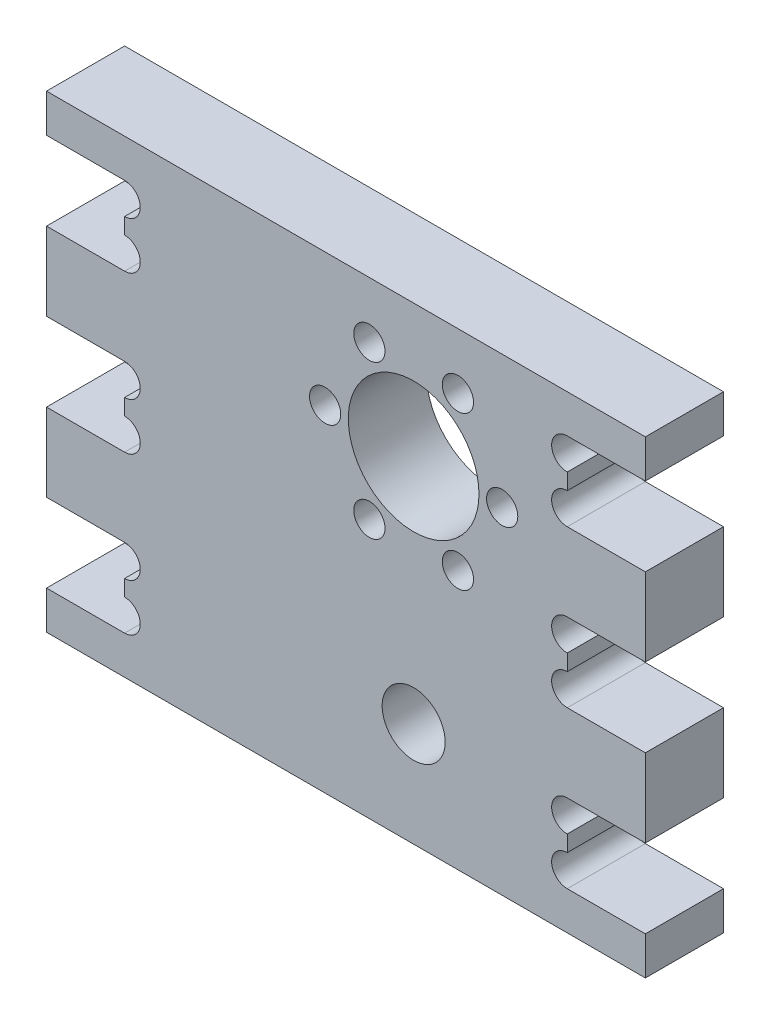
ISO-10303-21;
HEADER;
FILE_DESCRIPTION(('STEP AP214'),'2;1');
FILE_NAME('part.step','',(''),(''),'','','');
FILE_SCHEMA(('AUTOMOTIVE_DESIGN { 1 0 10303 214 1 1 1 1 }'));
ENDSEC;
DATA;
#1=APPLICATION_CONTEXT('core data for automotive mechanical design processes');
#2=APPLICATION_PROTOCOL_DEFINITION('international standard','automotive_design',2000,#1);
#3=PRODUCT_CONTEXT('',#1,'mechanical');
#4=PRODUCT('Part','Part','',(#3));
#5=PRODUCT_RELATED_PRODUCT_CATEGORY('part','',(#4));
#6=PRODUCT_DEFINITION_FORMATION('','',#4);
#7=PRODUCT_DEFINITION_CONTEXT('part definition',#1,'design');
#8=PRODUCT_DEFINITION('design','',#6,#7);
#9=PRODUCT_DEFINITION_SHAPE('','',#8);
#10=(LENGTH_UNIT() NAMED_UNIT(*) SI_UNIT(.MILLI.,.METRE.));
#11=(NAMED_UNIT(*) PLANE_ANGLE_UNIT() SI_UNIT($,.RADIAN.));
#12=(NAMED_UNIT(*) SI_UNIT($,.STERADIAN.) SOLID_ANGLE_UNIT());
#13=UNCERTAINTY_MEASURE_WITH_UNIT(LENGTH_MEASURE(1.E-05),#10,'distance_accuracy_value','');
#14=(GEOMETRIC_REPRESENTATION_CONTEXT(3) GLOBAL_UNCERTAINTY_ASSIGNED_CONTEXT((#13)) GLOBAL_UNIT_ASSIGNED_CONTEXT((#10,
#11,#12)) REPRESENTATION_CONTEXT('',''));
#15=CARTESIAN_POINT('',(0.,0.,0.));
#16=DIRECTION('',(0.,0.,1.));
#17=DIRECTION('',(1.,0.,0.));
#18=AXIS2_PLACEMENT_3D('',#15,#16,#17);
#19=CARTESIAN_POINT('',(0.,7.34999999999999,15.));
#20=DIRECTION('',(1.,0.,0.));
#21=DIRECTION('',(0.,1.,0.));
#22=AXIS2_PLACEMENT_3D('',#19,#20,#21);
#23=PLANE('',#22);
#24=DIRECTION('',(0.,-1.,0.));
#25=VECTOR('',#24,1.);
#26=CARTESIAN_POINT('',(0.,7.34999999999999,0.));
#27=LINE('',#26,#25);
#28=CARTESIAN_POINT('',(0.,7.34999999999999,0.));
#29=VERTEX_POINT('',#28);
#30=CARTESIAN_POINT('',(0.,0.,0.));
#31=VERTEX_POINT('',#30);
#32=EDGE_CURVE('E326',#29,#31,#27,.T.);
#33=ORIENTED_EDGE('',*,*,#32,.T.);
#34=DIRECTION('',(0.,0.,-1.));
#35=VECTOR('',#34,1.);
#36=CARTESIAN_POINT('',(0.,0.,15.));
#37=LINE('',#36,#35);
#38=CARTESIAN_POINT('',(0.,0.,15.));
#39=VERTEX_POINT('',#38);
#40=EDGE_CURVE('E11',#39,#31,#37,.T.);
#41=ORIENTED_EDGE('',*,*,#40,.F.);
#42=DIRECTION('',(0.,-1.,0.));
#43=VECTOR('',#42,1.);
#44=CARTESIAN_POINT('',(0.,7.34999999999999,15.));
#45=LINE('',#44,#43);
#46=CARTESIAN_POINT('',(0.,7.34999999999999,15.));
#47=VERTEX_POINT('',#46);
#48=EDGE_CURVE('E405',#47,#39,#45,.T.);
#49=ORIENTED_EDGE('',*,*,#48,.F.);
#50=DIRECTION('',(0.,0.,-1.));
#51=VECTOR('',#50,1.);
#52=CARTESIAN_POINT('',(0.,7.34999999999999,15.));
#53=LINE('',#52,#51);
#54=EDGE_CURVE('E322',#47,#29,#53,.T.);
#55=ORIENTED_EDGE('',*,*,#54,.T.);
#56=EDGE_LOOP('',(#33,#41,#49,#55));
#57=FACE_BOUND('',#56,.T.);
#58=ADVANCED_FACE('F38',(#57),#23,.F.);
#59=CARTESIAN_POINT('',(0.,0.,15.));
#60=DIRECTION('',(0.,1.,0.));
#61=DIRECTION('',(0.,0.,1.));
#62=AXIS2_PLACEMENT_3D('',#59,#60,#61);
#63=PLANE('',#62);
#64=DIRECTION('',(1.,0.,0.));
#65=VECTOR('',#64,1.);
#66=CARTESIAN_POINT('',(0.,0.,0.));
#67=LINE('',#66,#65);
#68=CARTESIAN_POINT('',(115.,0.,0.));
#69=VERTEX_POINT('',#68);
#70=EDGE_CURVE('E329',#31,#69,#67,.T.);
#71=ORIENTED_EDGE('',*,*,#70,.T.);
#72=DIRECTION('',(0.,0.,-1.));
#73=VECTOR('',#72,1.);
#74=CARTESIAN_POINT('',(115.,0.,15.));
#75=LINE('',#74,#73);
#76=CARTESIAN_POINT('',(115.,0.,15.));
#77=VERTEX_POINT('',#76);
#78=EDGE_CURVE('E46',#77,#69,#75,.T.);
#79=ORIENTED_EDGE('',*,*,#78,.F.);
#80=DIRECTION('',(1.,0.,0.));
#81=VECTOR('',#80,1.);
#82=CARTESIAN_POINT('',(0.,0.,15.));
#83=LINE('',#82,#81);
#84=EDGE_CURVE('E193',#39,#77,#83,.T.);
#85=ORIENTED_EDGE('',*,*,#84,.F.);
#86=ORIENTED_EDGE('',*,*,#40,.T.);
#87=EDGE_LOOP('',(#71,#79,#85,#86));
#88=FACE_BOUND('',#87,.T.);
#89=ADVANCED_FACE('F624',(#88),#63,.F.);
#90=CARTESIAN_POINT('',(115.,7.35,15.));
#91=DIRECTION('',(-1.,0.,0.));
#92=DIRECTION('',(0.,0.,1.));
#93=AXIS2_PLACEMENT_3D('',#90,#91,#92);
#94=PLANE('',#93);
#95=DIRECTION('',(0.,1.,0.));
#96=VECTOR('',#95,1.);
#97=CARTESIAN_POINT('',(115.,7.35,0.));
#98=LINE('',#97,#96);
#99=CARTESIAN_POINT('',(115.,7.35,0.));
#100=VERTEX_POINT('',#99);
#101=EDGE_CURVE('E332',#69,#100,#98,.T.);
#102=ORIENTED_EDGE('',*,*,#101,.T.);
#103=DIRECTION('',(0.,0.,-1.));
#104=VECTOR('',#103,1.);
#105=CARTESIAN_POINT('',(115.,7.35,15.));
#106=LINE('',#105,#104);
#107=CARTESIAN_POINT('',(115.,7.35,15.));
#108=VERTEX_POINT('',#107);
#109=EDGE_CURVE('E508',#108,#100,#106,.T.);
#110=ORIENTED_EDGE('',*,*,#109,.F.);
#111=DIRECTION('',(0.,1.,0.));
#112=VECTOR('',#111,1.);
#113=CARTESIAN_POINT('',(115.,7.35,15.));
#114=LINE('',#113,#112);
#115=EDGE_CURVE('E516',#77,#108,#114,.T.);
#116=ORIENTED_EDGE('',*,*,#115,.F.);
#117=ORIENTED_EDGE('',*,*,#78,.T.);
#118=EDGE_LOOP('',(#102,#110,#116,#117));
#119=FACE_BOUND('',#118,.T.);
#120=ADVANCED_FACE('F514',(#119),#94,.F.);
#121=CARTESIAN_POINT('',(100.,7.35,15.));
#122=DIRECTION('',(0.,-1.,0.));
#123=DIRECTION('',(0.,0.,-1.));
#124=AXIS2_PLACEMENT_3D('',#121,#122,#123);
#125=PLANE('',#124);
#126=DIRECTION('',(-1.,0.,0.));
#127=VECTOR('',#126,1.);
#128=CARTESIAN_POINT('',(100.,7.35,0.));
#129=LINE('',#128,#127);
#130=CARTESIAN_POINT('',(100.,7.35,0.));
#131=VERTEX_POINT('',#130);
#132=EDGE_CURVE('E334',#100,#131,#129,.T.);
#133=ORIENTED_EDGE('',*,*,#132,.T.);
#134=DIRECTION('',(0.,0.,-1.));
#135=VECTOR('',#134,1.);
#136=CARTESIAN_POINT('',(100.,7.35,15.));
#137=LINE('',#136,#135);
#138=CARTESIAN_POINT('',(100.,7.35,15.));
#139=VERTEX_POINT('',#138);
#140=EDGE_CURVE('E505',#139,#131,#137,.T.);
#141=ORIENTED_EDGE('',*,*,#140,.F.);
#142=DIRECTION('',(-1.,0.,0.));
#143=VECTOR('',#142,1.);
#144=CARTESIAN_POINT('',(100.,7.35,15.));
#145=LINE('',#144,#143);
#146=EDGE_CURVE('E534',#108,#139,#145,.T.);
#147=ORIENTED_EDGE('',*,*,#146,.F.);
#148=ORIENTED_EDGE('',*,*,#109,.T.);
#149=EDGE_LOOP('',(#133,#141,#147,#148));
#150=FACE_BOUND('',#149,.T.);
#151=ADVANCED_FACE('F525',(#150),#125,.F.);
#152=CARTESIAN_POINT('',(100.,10.35,15.));
#153=DIRECTION('',(0.,0.,-1.));
#154=DIRECTION('',(-1.,0.,0.));
#155=AXIS2_PLACEMENT_3D('',#152,#153,#154);
#156=CYLINDRICAL_SURFACE('',#155,3.);
#157=CARTESIAN_POINT('',(100.,10.35,0.));
#158=DIRECTION('',(0.,0.,-1.));
#159=DIRECTION('',(1.,0.,0.));
#160=AXIS2_PLACEMENT_3D('',#157,#158,#159);
#161=CIRCLE('',#160,3.);
#162=CARTESIAN_POINT('',(100.,13.35,0.));
#163=VERTEX_POINT('',#162);
#164=EDGE_CURVE('E336',#131,#163,#161,.T.);
#165=ORIENTED_EDGE('',*,*,#164,.T.);
#166=DIRECTION('',(0.,0.,-1.));
#167=VECTOR('',#166,1.);
#168=CARTESIAN_POINT('',(100.,13.35,15.));
#169=LINE('',#168,#167);
#170=CARTESIAN_POINT('',(100.,13.35,15.));
#171=VERTEX_POINT('',#170);
#172=EDGE_CURVE('E502',#171,#163,#169,.T.);
#173=ORIENTED_EDGE('',*,*,#172,.F.);
#174=CARTESIAN_POINT('',(100.,10.35,15.));
#175=DIRECTION('',(0.,0.,-1.));
#176=DIRECTION('',(1.,0.,0.));
#177=AXIS2_PLACEMENT_3D('',#174,#175,#176);
#178=CIRCLE('',#177,3.);
#179=EDGE_CURVE('E531',#139,#171,#178,.T.);
#180=ORIENTED_EDGE('',*,*,#179,.F.);
#181=ORIENTED_EDGE('',*,*,#140,.T.);
#182=EDGE_LOOP('',(#165,#173,#180,#181));
#183=FACE_BOUND('',#182,.T.);
#184=ADVANCED_FACE('F529',(#183),#156,.F.);
#185=CARTESIAN_POINT('',(100.,16.45,15.));
#186=DIRECTION('',(-1.,0.,0.));
#187=DIRECTION('',(0.,-1.,0.));
#188=AXIS2_PLACEMENT_3D('',#185,#186,#187);
#189=PLANE('',#188);
#190=DIRECTION('',(0.,1.,0.));
#191=VECTOR('',#190,1.);
#192=CARTESIAN_POINT('',(100.,16.45,0.));
#193=LINE('',#192,#191);
#194=CARTESIAN_POINT('',(100.,16.45,0.));
#195=VERTEX_POINT('',#194);
#196=EDGE_CURVE('E338',#163,#195,#193,.T.);
#197=ORIENTED_EDGE('',*,*,#196,.T.);
#198=DIRECTION('',(0.,0.,-1.));
#199=VECTOR('',#198,1.);
#200=CARTESIAN_POINT('',(100.,16.45,15.));
#201=LINE('',#200,#199);
#202=CARTESIAN_POINT('',(100.,16.45,15.));
#203=VERTEX_POINT('',#202);
#204=EDGE_CURVE('E499',#203,#195,#201,.T.);
#205=ORIENTED_EDGE('',*,*,#204,.F.);
#206=DIRECTION('',(0.,1.,0.));
#207=VECTOR('',#206,1.);
#208=CARTESIAN_POINT('',(100.,16.45,15.));
#209=LINE('',#208,#207);
#210=EDGE_CURVE('E533',#171,#203,#209,.T.);
#211=ORIENTED_EDGE('',*,*,#210,.F.);
#212=ORIENTED_EDGE('',*,*,#172,.T.);
#213=EDGE_LOOP('',(#197,#205,#211,#212));
#214=FACE_BOUND('',#213,.T.);
#215=ADVANCED_FACE('F637',(#214),#189,.F.);
#216=CARTESIAN_POINT('',(100.,19.45,15.));
#217=DIRECTION('',(0.,0.,-1.));
#218=DIRECTION('',(-1.,0.,0.));
#219=AXIS2_PLACEMENT_3D('',#216,#217,#218);
#220=CYLINDRICAL_SURFACE('',#219,3.);
#221=CARTESIAN_POINT('',(100.,19.45,0.));
#222=DIRECTION('',(0.,0.,-1.));
#223=DIRECTION('',(1.,0.,0.));
#224=AXIS2_PLACEMENT_3D('',#221,#222,#223);
#225=CIRCLE('',#224,3.);
#226=CARTESIAN_POINT('',(100.,22.45,0.));
#227=VERTEX_POINT('',#226);
#228=EDGE_CURVE('E340',#195,#227,#225,.T.);
#229=ORIENTED_EDGE('',*,*,#228,.T.);
#230=DIRECTION('',(0.,0.,-1.));
#231=VECTOR('',#230,1.);
#232=CARTESIAN_POINT('',(100.,22.45,15.));
#233=LINE('',#232,#231);
#234=CARTESIAN_POINT('',(100.,22.45,15.));
#235=VERTEX_POINT('',#234);
#236=EDGE_CURVE('E496',#235,#227,#233,.T.);
#237=ORIENTED_EDGE('',*,*,#236,.F.);
#238=CARTESIAN_POINT('',(100.,19.45,15.));
#239=DIRECTION('',(0.,0.,-1.));
#240=DIRECTION('',(1.,0.,0.));
#241=AXIS2_PLACEMENT_3D('',#238,#239,#240);
#242=CIRCLE('',#241,3.);
#243=EDGE_CURVE('E536',#203,#235,#242,.T.);
#244=ORIENTED_EDGE('',*,*,#243,.F.);
#245=ORIENTED_EDGE('',*,*,#204,.T.);
#246=EDGE_LOOP('',(#229,#237,#244,#245));
#247=FACE_BOUND('',#246,.T.);
#248=ADVANCED_FACE('F640',(#247),#220,.F.);
#249=CARTESIAN_POINT('',(115.,22.45,15.));
#250=DIRECTION('',(0.,1.,0.));
#251=DIRECTION('',(-1.,0.,0.));
#252=AXIS2_PLACEMENT_3D('',#249,#250,#251);
#253=PLANE('',#252);
#254=DIRECTION('',(1.,0.,0.));
#255=VECTOR('',#254,1.);
#256=CARTESIAN_POINT('',(115.,22.45,0.));
#257=LINE('',#256,#255);
#258=CARTESIAN_POINT('',(115.,22.45,0.));
#259=VERTEX_POINT('',#258);
#260=EDGE_CURVE('E342',#227,#259,#257,.T.);
#261=ORIENTED_EDGE('',*,*,#260,.T.);
#262=DIRECTION('',(0.,0.,-1.));
#263=VECTOR('',#262,1.);
#264=CARTESIAN_POINT('',(115.,22.45,15.));
#265=LINE('',#264,#263);
#266=CARTESIAN_POINT('',(115.,22.45,15.));
#267=VERTEX_POINT('',#266);
#268=EDGE_CURVE('E493',#267,#259,#265,.T.);
#269=ORIENTED_EDGE('',*,*,#268,.F.);
#270=DIRECTION('',(1.,0.,0.));
#271=VECTOR('',#270,1.);
#272=CARTESIAN_POINT('',(115.,22.45,15.));
#273=LINE('',#272,#271);
#274=EDGE_CURVE('E542',#235,#267,#273,.T.);
#275=ORIENTED_EDGE('',*,*,#274,.F.);
#276=ORIENTED_EDGE('',*,*,#236,.T.);
#277=EDGE_LOOP('',(#261,#269,#275,#276));
#278=FACE_BOUND('',#277,.T.);
#279=ADVANCED_FACE('F644',(#278),#253,.F.);
#280=CARTESIAN_POINT('',(115.,37.45,15.));
#281=DIRECTION('',(-1.,0.,0.));
#282=DIRECTION('',(0.,0.,1.));
#283=AXIS2_PLACEMENT_3D('',#280,#281,#282);
#284=PLANE('',#283);
#285=DIRECTION('',(0.,1.,0.));
#286=VECTOR('',#285,1.);
#287=CARTESIAN_POINT('',(115.,37.45,0.));
#288=LINE('',#287,#286);
#289=CARTESIAN_POINT('',(115.,37.45,0.));
#290=VERTEX_POINT('',#289);
#291=EDGE_CURVE('E344',#259,#290,#288,.T.);
#292=ORIENTED_EDGE('',*,*,#291,.T.);
#293=DIRECTION('',(0.,0.,-1.));
#294=VECTOR('',#293,1.);
#295=CARTESIAN_POINT('',(115.,37.45,15.));
#296=LINE('',#295,#294);
#297=CARTESIAN_POINT('',(115.,37.45,15.));
#298=VERTEX_POINT('',#297);
#299=EDGE_CURVE('E490',#298,#290,#296,.T.);
#300=ORIENTED_EDGE('',*,*,#299,.F.);
#301=DIRECTION('',(0.,1.,0.));
#302=VECTOR('',#301,1.);
#303=CARTESIAN_POINT('',(115.,37.45,15.));
#304=LINE('',#303,#302);
#305=EDGE_CURVE('E544',#267,#298,#304,.T.);
#306=ORIENTED_EDGE('',*,*,#305,.F.);
#307=ORIENTED_EDGE('',*,*,#268,.T.);
#308=EDGE_LOOP('',(#292,#300,#306,#307));
#309=FACE_BOUND('',#308,.T.);
#310=ADVANCED_FACE('F648',(#309),#284,.F.);
#311=CARTESIAN_POINT('',(100.,37.45,15.));
#312=DIRECTION('',(0.,-1.,0.));
#313=DIRECTION('',(0.,0.,-1.));
#314=AXIS2_PLACEMENT_3D('',#311,#312,#313);
#315=PLANE('',#314);
#316=DIRECTION('',(-1.,0.,0.));
#317=VECTOR('',#316,1.);
#318=CARTESIAN_POINT('',(100.,37.45,0.));
#319=LINE('',#318,#317);
#320=CARTESIAN_POINT('',(100.,37.45,0.));
#321=VERTEX_POINT('',#320);
#322=EDGE_CURVE('E346',#290,#321,#319,.T.);
#323=ORIENTED_EDGE('',*,*,#322,.T.);
#324=DIRECTION('',(0.,0.,-1.));
#325=VECTOR('',#324,1.);
#326=CARTESIAN_POINT('',(100.,37.45,15.));
#327=LINE('',#326,#325);
#328=CARTESIAN_POINT('',(100.,37.45,15.));
#329=VERTEX_POINT('',#328);
#330=EDGE_CURVE('E487',#329,#321,#327,.T.);
#331=ORIENTED_EDGE('',*,*,#330,.F.);
#332=DIRECTION('',(-1.,0.,0.));
#333=VECTOR('',#332,1.);
#334=CARTESIAN_POINT('',(100.,37.45,15.));
#335=LINE('',#334,#333);
#336=EDGE_CURVE('E546',#298,#329,#335,.T.);
#337=ORIENTED_EDGE('',*,*,#336,.F.);
#338=ORIENTED_EDGE('',*,*,#299,.T.);
#339=EDGE_LOOP('',(#323,#331,#337,#338));
#340=FACE_BOUND('',#339,.T.);
#341=ADVANCED_FACE('F652',(#340),#315,.F.);
#342=CARTESIAN_POINT('',(100.,40.45,15.));
#343=DIRECTION('',(0.,0.,-1.));
#344=DIRECTION('',(-1.,0.,0.));
#345=AXIS2_PLACEMENT_3D('',#342,#343,#344);
#346=CYLINDRICAL_SURFACE('',#345,3.00000000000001);
#347=CARTESIAN_POINT('',(100.,40.45,0.));
#348=DIRECTION('',(0.,0.,-1.));
#349=DIRECTION('',(1.,0.,0.));
#350=AXIS2_PLACEMENT_3D('',#347,#348,#349);
#351=CIRCLE('',#350,3.00000000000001);
#352=CARTESIAN_POINT('',(100.,43.45,0.));
#353=VERTEX_POINT('',#352);
#354=EDGE_CURVE('E348',#321,#353,#351,.T.);
#355=ORIENTED_EDGE('',*,*,#354,.T.);
#356=DIRECTION('',(0.,0.,-1.));
#357=VECTOR('',#356,1.);
#358=CARTESIAN_POINT('',(100.,43.45,15.));
#359=LINE('',#358,#357);
#360=CARTESIAN_POINT('',(100.,43.45,15.));
#361=VERTEX_POINT('',#360);
#362=EDGE_CURVE('E484',#361,#353,#359,.T.);
#363=ORIENTED_EDGE('',*,*,#362,.F.);
#364=CARTESIAN_POINT('',(100.,40.45,15.));
#365=DIRECTION('',(0.,0.,-1.));
#366=DIRECTION('',(1.,0.,0.));
#367=AXIS2_PLACEMENT_3D('',#364,#365,#366);
#368=CIRCLE('',#367,3.00000000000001);
#369=EDGE_CURVE('E548',#329,#361,#368,.T.);
#370=ORIENTED_EDGE('',*,*,#369,.F.);
#371=ORIENTED_EDGE('',*,*,#330,.T.);
#372=EDGE_LOOP('',(#355,#363,#370,#371));
#373=FACE_BOUND('',#372,.T.);
#374=ADVANCED_FACE('F656',(#373),#346,.F.);
#375=CARTESIAN_POINT('',(100.,46.55,15.));
#376=DIRECTION('',(-1.,0.,0.));
#377=DIRECTION('',(0.,-1.,0.));
#378=AXIS2_PLACEMENT_3D('',#375,#376,#377);
#379=PLANE('',#378);
#380=DIRECTION('',(0.,1.,0.));
#381=VECTOR('',#380,1.);
#382=CARTESIAN_POINT('',(100.,46.55,0.));
#383=LINE('',#382,#381);
#384=CARTESIAN_POINT('',(100.,46.55,0.));
#385=VERTEX_POINT('',#384);
#386=EDGE_CURVE('E350',#353,#385,#383,.T.);
#387=ORIENTED_EDGE('',*,*,#386,.T.);
#388=DIRECTION('',(0.,0.,-1.));
#389=VECTOR('',#388,1.);
#390=CARTESIAN_POINT('',(100.,46.55,15.));
#391=LINE('',#390,#389);
#392=CARTESIAN_POINT('',(100.,46.55,15.));
#393=VERTEX_POINT('',#392);
#394=EDGE_CURVE('E481',#393,#385,#391,.T.);
#395=ORIENTED_EDGE('',*,*,#394,.F.);
#396=DIRECTION('',(0.,1.,0.));
#397=VECTOR('',#396,1.);
#398=CARTESIAN_POINT('',(100.,46.55,15.));
#399=LINE('',#398,#397);
#400=EDGE_CURVE('E550',#361,#393,#399,.T.);
#401=ORIENTED_EDGE('',*,*,#400,.F.);
#402=ORIENTED_EDGE('',*,*,#362,.T.);
#403=EDGE_LOOP('',(#387,#395,#401,#402));
#404=FACE_BOUND('',#403,.T.);
#405=ADVANCED_FACE('F660',(#404),#379,.F.);
#406=CARTESIAN_POINT('',(100.,49.55,15.));
#407=DIRECTION('',(0.,0.,-1.));
#408=DIRECTION('',(-1.,0.,0.));
#409=AXIS2_PLACEMENT_3D('',#406,#407,#408);
#410=CYLINDRICAL_SURFACE('',#409,3.);
#411=CARTESIAN_POINT('',(100.,49.55,0.));
#412=DIRECTION('',(0.,0.,-1.));
#413=DIRECTION('',(1.,0.,0.));
#414=AXIS2_PLACEMENT_3D('',#411,#412,#413);
#415=CIRCLE('',#414,3.);
#416=CARTESIAN_POINT('',(100.,52.55,0.));
#417=VERTEX_POINT('',#416);
#418=EDGE_CURVE('E352',#385,#417,#415,.T.);
#419=ORIENTED_EDGE('',*,*,#418,.T.);
#420=DIRECTION('',(0.,0.,-1.));
#421=VECTOR('',#420,1.);
#422=CARTESIAN_POINT('',(100.,52.55,15.));
#423=LINE('',#422,#421);
#424=CARTESIAN_POINT('',(100.,52.55,15.));
#425=VERTEX_POINT('',#424);
#426=EDGE_CURVE('E478',#425,#417,#423,.T.);
#427=ORIENTED_EDGE('',*,*,#426,.F.);
#428=CARTESIAN_POINT('',(100.,49.55,15.));
#429=DIRECTION('',(0.,0.,-1.));
#430=DIRECTION('',(1.,0.,0.));
#431=AXIS2_PLACEMENT_3D('',#428,#429,#430);
#432=CIRCLE('',#431,3.);
#433=EDGE_CURVE('E552',#393,#425,#432,.T.);
#434=ORIENTED_EDGE('',*,*,#433,.F.);
#435=ORIENTED_EDGE('',*,*,#394,.T.);
#436=EDGE_LOOP('',(#419,#427,#434,#435));
#437=FACE_BOUND('',#436,.T.);
#438=ADVANCED_FACE('F664',(#437),#410,.F.);
#439=CARTESIAN_POINT('',(115.,52.55,15.));
#440=DIRECTION('',(0.,1.,0.));
#441=DIRECTION('',(0.,0.,1.));
#442=AXIS2_PLACEMENT_3D('',#439,#440,#441);
#443=PLANE('',#442);
#444=DIRECTION('',(1.,0.,0.));
#445=VECTOR('',#444,1.);
#446=CARTESIAN_POINT('',(115.,52.55,0.));
#447=LINE('',#446,#445);
#448=CARTESIAN_POINT('',(115.,52.55,0.));
#449=VERTEX_POINT('',#448);
#450=EDGE_CURVE('E354',#417,#449,#447,.T.);
#451=ORIENTED_EDGE('',*,*,#450,.T.);
#452=DIRECTION('',(0.,0.,-1.));
#453=VECTOR('',#452,1.);
#454=CARTESIAN_POINT('',(115.,52.55,15.));
#455=LINE('',#454,#453);
#456=CARTESIAN_POINT('',(115.,52.55,15.));
#457=VERTEX_POINT('',#456);
#458=EDGE_CURVE('E475',#457,#449,#455,.T.);
#459=ORIENTED_EDGE('',*,*,#458,.F.);
#460=DIRECTION('',(1.,0.,0.));
#461=VECTOR('',#460,1.);
#462=CARTESIAN_POINT('',(115.,52.55,15.));
#463=LINE('',#462,#461);
#464=EDGE_CURVE('E554',#425,#457,#463,.T.);
#465=ORIENTED_EDGE('',*,*,#464,.F.);
#466=ORIENTED_EDGE('',*,*,#426,.T.);
#467=EDGE_LOOP('',(#451,#459,#465,#466));
#468=FACE_BOUND('',#467,.T.);
#469=ADVANCED_FACE('F668',(#468),#443,.F.);
#470=CARTESIAN_POINT('',(115.,67.55,15.));
#471=DIRECTION('',(-1.,0.,0.));
#472=DIRECTION('',(0.,0.,1.));
#473=AXIS2_PLACEMENT_3D('',#470,#471,#472);
#474=PLANE('',#473);
#475=DIRECTION('',(0.,1.,0.));
#476=VECTOR('',#475,1.);
#477=CARTESIAN_POINT('',(115.,67.55,0.));
#478=LINE('',#477,#476);
#479=CARTESIAN_POINT('',(115.,67.55,0.));
#480=VERTEX_POINT('',#479);
#481=EDGE_CURVE('E356',#449,#480,#478,.T.);
#482=ORIENTED_EDGE('',*,*,#481,.T.);
#483=DIRECTION('',(0.,0.,-1.));
#484=VECTOR('',#483,1.);
#485=CARTESIAN_POINT('',(115.,67.55,15.));
#486=LINE('',#485,#484);
#487=CARTESIAN_POINT('',(115.,67.55,15.));
#488=VERTEX_POINT('',#487);
#489=EDGE_CURVE('E472',#488,#480,#486,.T.);
#490=ORIENTED_EDGE('',*,*,#489,.F.);
#491=DIRECTION('',(0.,1.,0.));
#492=VECTOR('',#491,1.);
#493=CARTESIAN_POINT('',(115.,67.55,15.));
#494=LINE('',#493,#492);
#495=EDGE_CURVE('E556',#457,#488,#494,.T.);
#496=ORIENTED_EDGE('',*,*,#495,.F.);
#497=ORIENTED_EDGE('',*,*,#458,.T.);
#498=EDGE_LOOP('',(#482,#490,#496,#497));
#499=FACE_BOUND('',#498,.T.);
#500=ADVANCED_FACE('F672',(#499),#474,.F.);
#501=CARTESIAN_POINT('',(100.,67.55,15.));
#502=DIRECTION('',(0.,-1.,0.));
#503=DIRECTION('',(0.,0.,-1.));
#504=AXIS2_PLACEMENT_3D('',#501,#502,#503);
#505=PLANE('',#504);
#506=DIRECTION('',(-1.,0.,0.));
#507=VECTOR('',#506,1.);
#508=CARTESIAN_POINT('',(100.,67.55,0.));
#509=LINE('',#508,#507);
#510=CARTESIAN_POINT('',(100.,67.55,0.));
#511=VERTEX_POINT('',#510);
#512=EDGE_CURVE('E358',#480,#511,#509,.T.);
#513=ORIENTED_EDGE('',*,*,#512,.T.);
#514=DIRECTION('',(0.,0.,-1.));
#515=VECTOR('',#514,1.);
#516=CARTESIAN_POINT('',(100.,67.55,15.));
#517=LINE('',#516,#515);
#518=CARTESIAN_POINT('',(100.,67.55,15.));
#519=VERTEX_POINT('',#518);
#520=EDGE_CURVE('E469',#519,#511,#517,.T.);
#521=ORIENTED_EDGE('',*,*,#520,.F.);
#522=DIRECTION('',(-1.,0.,0.));
#523=VECTOR('',#522,1.);
#524=CARTESIAN_POINT('',(100.,67.55,15.));
#525=LINE('',#524,#523);
#526=EDGE_CURVE('E558',#488,#519,#525,.T.);
#527=ORIENTED_EDGE('',*,*,#526,.F.);
#528=ORIENTED_EDGE('',*,*,#489,.T.);
#529=EDGE_LOOP('',(#513,#521,#527,#528));
#530=FACE_BOUND('',#529,.T.);
#531=ADVANCED_FACE('F676',(#530),#505,.F.);
#532=CARTESIAN_POINT('',(100.,70.55,15.));
#533=DIRECTION('',(0.,0.,-1.));
#534=DIRECTION('',(-1.,0.,0.));
#535=AXIS2_PLACEMENT_3D('',#532,#533,#534);
#536=CYLINDRICAL_SURFACE('',#535,3.);
#537=CARTESIAN_POINT('',(100.,70.55,0.));
#538=DIRECTION('',(0.,0.,-1.));
#539=DIRECTION('',(1.,0.,0.));
#540=AXIS2_PLACEMENT_3D('',#537,#538,#539);
#541=CIRCLE('',#540,3.);
#542=CARTESIAN_POINT('',(100.,73.55,0.));
#543=VERTEX_POINT('',#542);
#544=EDGE_CURVE('E360',#511,#543,#541,.T.);
#545=ORIENTED_EDGE('',*,*,#544,.T.);
#546=DIRECTION('',(0.,0.,-1.));
#547=VECTOR('',#546,1.);
#548=CARTESIAN_POINT('',(100.,73.55,15.));
#549=LINE('',#548,#547);
#550=CARTESIAN_POINT('',(100.,73.55,15.));
#551=VERTEX_POINT('',#550);
#552=EDGE_CURVE('E466',#551,#543,#549,.T.);
#553=ORIENTED_EDGE('',*,*,#552,.F.);
#554=CARTESIAN_POINT('',(100.,70.55,15.));
#555=DIRECTION('',(0.,0.,-1.));
#556=DIRECTION('',(1.,0.,0.));
#557=AXIS2_PLACEMENT_3D('',#554,#555,#556);
#558=CIRCLE('',#557,3.);
#559=EDGE_CURVE('E560',#519,#551,#558,.T.);
#560=ORIENTED_EDGE('',*,*,#559,.F.);
#561=ORIENTED_EDGE('',*,*,#520,.T.);
#562=EDGE_LOOP('',(#545,#553,#560,#561));
#563=FACE_BOUND('',#562,.T.);
#564=ADVANCED_FACE('F680',(#563),#536,.F.);
#565=CARTESIAN_POINT('',(100.,76.65,15.));
#566=DIRECTION('',(-1.,0.,0.));
#567=DIRECTION('',(0.,0.,1.));
#568=AXIS2_PLACEMENT_3D('',#565,#566,#567);
#569=PLANE('',#568);
#570=DIRECTION('',(0.,1.,0.));
#571=VECTOR('',#570,1.);
#572=CARTESIAN_POINT('',(100.,76.65,0.));
#573=LINE('',#572,#571);
#574=CARTESIAN_POINT('',(100.,76.65,0.));
#575=VERTEX_POINT('',#574);
#576=EDGE_CURVE('E362',#543,#575,#573,.T.);
#577=ORIENTED_EDGE('',*,*,#576,.T.);
#578=DIRECTION('',(0.,0.,-1.));
#579=VECTOR('',#578,1.);
#580=CARTESIAN_POINT('',(100.,76.65,15.));
#581=LINE('',#580,#579);
#582=CARTESIAN_POINT('',(100.,76.65,15.));
#583=VERTEX_POINT('',#582);
#584=EDGE_CURVE('E463',#583,#575,#581,.T.);
#585=ORIENTED_EDGE('',*,*,#584,.F.);
#586=DIRECTION('',(0.,1.,0.));
#587=VECTOR('',#586,1.);
#588=CARTESIAN_POINT('',(100.,76.65,15.));
#589=LINE('',#588,#587);
#590=EDGE_CURVE('E562',#551,#583,#589,.T.);
#591=ORIENTED_EDGE('',*,*,#590,.F.);
#592=ORIENTED_EDGE('',*,*,#552,.T.);
#593=EDGE_LOOP('',(#577,#585,#591,#592));
#594=FACE_BOUND('',#593,.T.);
#595=ADVANCED_FACE('F684',(#594),#569,.F.);
#596=CARTESIAN_POINT('',(100.,79.65,15.));
#597=DIRECTION('',(0.,0.,-1.));
#598=DIRECTION('',(-1.,0.,0.));
#599=AXIS2_PLACEMENT_3D('',#596,#597,#598);
#600=CYLINDRICAL_SURFACE('',#599,3.);
#601=CARTESIAN_POINT('',(100.,79.65,0.));
#602=DIRECTION('',(0.,0.,-1.));
#603=DIRECTION('',(1.,0.,0.));
#604=AXIS2_PLACEMENT_3D('',#601,#602,#603);
#605=CIRCLE('',#604,3.);
#606=CARTESIAN_POINT('',(100.,82.65,0.));
#607=VERTEX_POINT('',#606);
#608=EDGE_CURVE('E364',#575,#607,#605,.T.);
#609=ORIENTED_EDGE('',*,*,#608,.T.);
#610=DIRECTION('',(0.,0.,-1.));
#611=VECTOR('',#610,1.);
#612=CARTESIAN_POINT('',(100.,82.65,15.));
#613=LINE('',#612,#611);
#614=CARTESIAN_POINT('',(100.,82.65,15.));
#615=VERTEX_POINT('',#614);
#616=EDGE_CURVE('E460',#615,#607,#613,.T.);
#617=ORIENTED_EDGE('',*,*,#616,.F.);
#618=CARTESIAN_POINT('',(100.,79.65,15.));
#619=DIRECTION('',(0.,0.,-1.));
#620=DIRECTION('',(1.,0.,0.));
#621=AXIS2_PLACEMENT_3D('',#618,#619,#620);
#622=CIRCLE('',#621,3.);
#623=EDGE_CURVE('E564',#583,#615,#622,.T.);
#624=ORIENTED_EDGE('',*,*,#623,.F.);
#625=ORIENTED_EDGE('',*,*,#584,.T.);
#626=EDGE_LOOP('',(#609,#617,#624,#625));
#627=FACE_BOUND('',#626,.T.);
#628=ADVANCED_FACE('F688',(#627),#600,.F.);
#629=CARTESIAN_POINT('',(115.,82.65,15.));
#630=DIRECTION('',(0.,1.,0.));
#631=DIRECTION('',(0.,0.,1.));
#632=AXIS2_PLACEMENT_3D('',#629,#630,#631);
#633=PLANE('',#632);
#634=DIRECTION('',(1.,0.,0.));
#635=VECTOR('',#634,1.);
#636=CARTESIAN_POINT('',(115.,82.65,0.));
#637=LINE('',#636,#635);
#638=CARTESIAN_POINT('',(115.,82.65,0.));
#639=VERTEX_POINT('',#638);
#640=EDGE_CURVE('E366',#607,#639,#637,.T.);
#641=ORIENTED_EDGE('',*,*,#640,.T.);
#642=DIRECTION('',(0.,0.,-1.));
#643=VECTOR('',#642,1.);
#644=CARTESIAN_POINT('',(115.,82.65,15.));
#645=LINE('',#644,#643);
#646=CARTESIAN_POINT('',(115.,82.65,15.));
#647=VERTEX_POINT('',#646);
#648=EDGE_CURVE('E457',#647,#639,#645,.T.);
#649=ORIENTED_EDGE('',*,*,#648,.F.);
#650=DIRECTION('',(1.,0.,0.));
#651=VECTOR('',#650,1.);
#652=CARTESIAN_POINT('',(115.,82.65,15.));
#653=LINE('',#652,#651);
#654=EDGE_CURVE('E566',#615,#647,#653,.T.);
#655=ORIENTED_EDGE('',*,*,#654,.F.);
#656=ORIENTED_EDGE('',*,*,#616,.T.);
#657=EDGE_LOOP('',(#641,#649,#655,#656));
#658=FACE_BOUND('',#657,.T.);
#659=ADVANCED_FACE('F692',(#658),#633,.F.);
#660=CARTESIAN_POINT('',(115.,90.,15.));
#661=DIRECTION('',(-1.,0.,0.));
#662=DIRECTION('',(0.,0.,1.));
#663=AXIS2_PLACEMENT_3D('',#660,#661,#662);
#664=PLANE('',#663);
#665=DIRECTION('',(0.,1.,0.));
#666=VECTOR('',#665,1.);
#667=CARTESIAN_POINT('',(115.,90.,0.));
#668=LINE('',#667,#666);
#669=CARTESIAN_POINT('',(115.,90.,0.));
#670=VERTEX_POINT('',#669);
#671=EDGE_CURVE('E368',#639,#670,#668,.T.);
#672=ORIENTED_EDGE('',*,*,#671,.T.);
#673=DIRECTION('',(0.,0.,-1.));
#674=VECTOR('',#673,1.);
#675=CARTESIAN_POINT('',(115.,90.,15.));
#676=LINE('',#675,#674);
#677=CARTESIAN_POINT('',(115.,90.,15.));
#678=VERTEX_POINT('',#677);
#679=EDGE_CURVE('E454',#678,#670,#676,.T.);
#680=ORIENTED_EDGE('',*,*,#679,.F.);
#681=DIRECTION('',(0.,1.,0.));
#682=VECTOR('',#681,1.);
#683=CARTESIAN_POINT('',(115.,90.,15.));
#684=LINE('',#683,#682);
#685=EDGE_CURVE('E568',#647,#678,#684,.T.);
#686=ORIENTED_EDGE('',*,*,#685,.F.);
#687=ORIENTED_EDGE('',*,*,#648,.T.);
#688=EDGE_LOOP('',(#672,#680,#686,#687));
#689=FACE_BOUND('',#688,.T.);
#690=ADVANCED_FACE('F696',(#689),#664,.F.);
#691=CARTESIAN_POINT('',(0.,90.,15.));
#692=DIRECTION('',(0.,-1.,0.));
#693=DIRECTION('',(0.,0.,-1.));
#694=AXIS2_PLACEMENT_3D('',#691,#692,#693);
#695=PLANE('',#694);
#696=DIRECTION('',(-1.,0.,0.));
#697=VECTOR('',#696,1.);
#698=CARTESIAN_POINT('',(0.,90.,0.));
#699=LINE('',#698,#697);
#700=CARTESIAN_POINT('',(0.,90.,0.));
#701=VERTEX_POINT('',#700);
#702=EDGE_CURVE('E370',#670,#701,#699,.T.);
#703=ORIENTED_EDGE('',*,*,#702,.T.);
#704=DIRECTION('',(0.,0.,-1.));
#705=VECTOR('',#704,1.);
#706=CARTESIAN_POINT('',(0.,90.,15.));
#707=LINE('',#706,#705);
#708=CARTESIAN_POINT('',(0.,90.,15.));
#709=VERTEX_POINT('',#708);
#710=EDGE_CURVE('E451',#709,#701,#707,.T.);
#711=ORIENTED_EDGE('',*,*,#710,.F.);
#712=DIRECTION('',(-1.,0.,0.));
#713=VECTOR('',#712,1.);
#714=CARTESIAN_POINT('',(0.,90.,15.));
#715=LINE('',#714,#713);
#716=EDGE_CURVE('E570',#678,#709,#715,.T.);
#717=ORIENTED_EDGE('',*,*,#716,.F.);
#718=ORIENTED_EDGE('',*,*,#679,.T.);
#719=EDGE_LOOP('',(#703,#711,#717,#718));
#720=FACE_BOUND('',#719,.T.);
#721=ADVANCED_FACE('F700',(#720),#695,.F.);
#722=CARTESIAN_POINT('',(0.,82.65,15.));
#723=DIRECTION('',(1.,0.,0.));
#724=DIRECTION('',(0.,1.,0.));
#725=AXIS2_PLACEMENT_3D('',#722,#723,#724);
#726=PLANE('',#725);
#727=DIRECTION('',(0.,-1.,0.));
#728=VECTOR('',#727,1.);
#729=CARTESIAN_POINT('',(0.,82.65,0.));
#730=LINE('',#729,#728);
#731=CARTESIAN_POINT('',(0.,82.65,0.));
#732=VERTEX_POINT('',#731);
#733=EDGE_CURVE('E372',#701,#732,#730,.T.);
#734=ORIENTED_EDGE('',*,*,#733,.T.);
#735=DIRECTION('',(0.,0.,-1.));
#736=VECTOR('',#735,1.);
#737=CARTESIAN_POINT('',(0.,82.65,15.));
#738=LINE('',#737,#736);
#739=CARTESIAN_POINT('',(0.,82.65,15.));
#740=VERTEX_POINT('',#739);
#741=EDGE_CURVE('E448',#740,#732,#738,.T.);
#742=ORIENTED_EDGE('',*,*,#741,.F.);
#743=DIRECTION('',(0.,-1.,0.));
#744=VECTOR('',#743,1.);
#745=CARTESIAN_POINT('',(0.,82.65,15.));
#746=LINE('',#745,#744);
#747=EDGE_CURVE('E572',#709,#740,#746,.T.);
#748=ORIENTED_EDGE('',*,*,#747,.F.);
#749=ORIENTED_EDGE('',*,*,#710,.T.);
#750=EDGE_LOOP('',(#734,#742,#748,#749));
#751=FACE_BOUND('',#750,.T.);
#752=ADVANCED_FACE('F704',(#751),#726,.F.);
#753=CARTESIAN_POINT('',(15.,82.65,15.));
#754=DIRECTION('',(0.,1.,0.));
#755=DIRECTION('',(-1.,0.,0.));
#756=AXIS2_PLACEMENT_3D('',#753,#754,#755);
#757=PLANE('',#756);
#758=DIRECTION('',(1.,0.,0.));
#759=VECTOR('',#758,1.);
#760=CARTESIAN_POINT('',(15.,82.65,0.));
#761=LINE('',#760,#759);
#762=CARTESIAN_POINT('',(15.,82.65,0.));
#763=VERTEX_POINT('',#762);
#764=EDGE_CURVE('E374',#732,#763,#761,.T.);
#765=ORIENTED_EDGE('',*,*,#764,.T.);
#766=DIRECTION('',(0.,0.,-1.));
#767=VECTOR('',#766,1.);
#768=CARTESIAN_POINT('',(15.,82.65,15.));
#769=LINE('',#768,#767);
#770=CARTESIAN_POINT('',(15.,82.65,15.));
#771=VERTEX_POINT('',#770);
#772=EDGE_CURVE('E445',#771,#763,#769,.T.);
#773=ORIENTED_EDGE('',*,*,#772,.F.);
#774=DIRECTION('',(1.,0.,0.));
#775=VECTOR('',#774,1.);
#776=CARTESIAN_POINT('',(15.,82.65,15.));
#777=LINE('',#776,#775);
#778=EDGE_CURVE('E574',#740,#771,#777,.T.);
#779=ORIENTED_EDGE('',*,*,#778,.F.);
#780=ORIENTED_EDGE('',*,*,#741,.T.);
#781=EDGE_LOOP('',(#765,#773,#779,#780));
#782=FACE_BOUND('',#781,.T.);
#783=ADVANCED_FACE('F708',(#782),#757,.F.);
#784=CARTESIAN_POINT('',(15.,79.65,15.));
#785=DIRECTION('',(0.,0.,-1.));
#786=DIRECTION('',(-1.,0.,0.));
#787=AXIS2_PLACEMENT_3D('',#784,#785,#786);
#788=CYLINDRICAL_SURFACE('',#787,3.);
#789=CARTESIAN_POINT('',(15.,79.65,0.));
#790=DIRECTION('',(0.,0.,-1.));
#791=DIRECTION('',(-1.,0.,0.));
#792=AXIS2_PLACEMENT_3D('',#789,#790,#791);
#793=CIRCLE('',#792,3.);
#794=CARTESIAN_POINT('',(15.,76.65,0.));
#795=VERTEX_POINT('',#794);
#796=EDGE_CURVE('E376',#763,#795,#793,.T.);
#797=ORIENTED_EDGE('',*,*,#796,.T.);
#798=DIRECTION('',(0.,0.,-1.));
#799=VECTOR('',#798,1.);
#800=CARTESIAN_POINT('',(15.,76.65,15.));
#801=LINE('',#800,#799);
#802=CARTESIAN_POINT('',(15.,76.65,15.));
#803=VERTEX_POINT('',#802);
#804=EDGE_CURVE('E442',#803,#795,#801,.T.);
#805=ORIENTED_EDGE('',*,*,#804,.F.);
#806=CARTESIAN_POINT('',(15.,79.65,15.));
#807=DIRECTION('',(0.,0.,-1.));
#808=DIRECTION('',(-1.,0.,0.));
#809=AXIS2_PLACEMENT_3D('',#806,#807,#808);
#810=CIRCLE('',#809,3.);
#811=EDGE_CURVE('E576',#771,#803,#810,.T.);
#812=ORIENTED_EDGE('',*,*,#811,.F.);
#813=ORIENTED_EDGE('',*,*,#772,.T.);
#814=EDGE_LOOP('',(#797,#805,#812,#813));
#815=FACE_BOUND('',#814,.T.);
#816=ADVANCED_FACE('F712',(#815),#788,.F.);
#817=CARTESIAN_POINT('',(15.,76.65,15.));
#818=DIRECTION('',(1.,0.,0.));
#819=DIRECTION('',(0.,1.,0.));
#820=AXIS2_PLACEMENT_3D('',#817,#818,#819);
#821=PLANE('',#820);
#822=DIRECTION('',(0.,-1.,0.));
#823=VECTOR('',#822,1.);
#824=CARTESIAN_POINT('',(15.,76.65,0.));
#825=LINE('',#824,#823);
#826=CARTESIAN_POINT('',(15.,73.55,0.));
#827=VERTEX_POINT('',#826);
#828=EDGE_CURVE('E378',#795,#827,#825,.T.);
#829=ORIENTED_EDGE('',*,*,#828,.T.);
#830=DIRECTION('',(0.,0.,-1.));
#831=VECTOR('',#830,1.);
#832=CARTESIAN_POINT('',(15.,73.55,15.));
#833=LINE('',#832,#831);
#834=CARTESIAN_POINT('',(15.,73.55,15.));
#835=VERTEX_POINT('',#834);
#836=EDGE_CURVE('E439',#835,#827,#833,.T.);
#837=ORIENTED_EDGE('',*,*,#836,.F.);
#838=DIRECTION('',(0.,-1.,0.));
#839=VECTOR('',#838,1.);
#840=CARTESIAN_POINT('',(15.,76.65,15.));
#841=LINE('',#840,#839);
#842=EDGE_CURVE('E578',#803,#835,#841,.T.);
#843=ORIENTED_EDGE('',*,*,#842,.F.);
#844=ORIENTED_EDGE('',*,*,#804,.T.);
#845=EDGE_LOOP('',(#829,#837,#843,#844));
#846=FACE_BOUND('',#845,.T.);
#847=ADVANCED_FACE('F716',(#846),#821,.F.);
#848=CARTESIAN_POINT('',(15.,70.55,15.));
#849=DIRECTION('',(0.,0.,-1.));
#850=DIRECTION('',(-1.,0.,0.));
#851=AXIS2_PLACEMENT_3D('',#848,#849,#850);
#852=CYLINDRICAL_SURFACE('',#851,3.);
#853=CARTESIAN_POINT('',(15.,70.55,0.));
#854=DIRECTION('',(0.,0.,-1.));
#855=DIRECTION('',(-1.,0.,0.));
#856=AXIS2_PLACEMENT_3D('',#853,#854,#855);
#857=CIRCLE('',#856,3.);
#858=CARTESIAN_POINT('',(15.,67.55,0.));
#859=VERTEX_POINT('',#858);
#860=EDGE_CURVE('E380',#827,#859,#857,.T.);
#861=ORIENTED_EDGE('',*,*,#860,.T.);
#862=DIRECTION('',(0.,0.,-1.));
#863=VECTOR('',#862,1.);
#864=CARTESIAN_POINT('',(15.,67.55,15.));
#865=LINE('',#864,#863);
#866=CARTESIAN_POINT('',(15.,67.55,15.));
#867=VERTEX_POINT('',#866);
#868=EDGE_CURVE('E436',#867,#859,#865,.T.);
#869=ORIENTED_EDGE('',*,*,#868,.F.);
#870=CARTESIAN_POINT('',(15.,70.55,15.));
#871=DIRECTION('',(0.,0.,-1.));
#872=DIRECTION('',(-1.,0.,0.));
#873=AXIS2_PLACEMENT_3D('',#870,#871,#872);
#874=CIRCLE('',#873,3.);
#875=EDGE_CURVE('E580',#835,#867,#874,.T.);
#876=ORIENTED_EDGE('',*,*,#875,.F.);
#877=ORIENTED_EDGE('',*,*,#836,.T.);
#878=EDGE_LOOP('',(#861,#869,#876,#877));
#879=FACE_BOUND('',#878,.T.);
#880=ADVANCED_FACE('F720',(#879),#852,.F.);
#881=CARTESIAN_POINT('',(15.,67.55,15.));
#882=DIRECTION('',(0.,-1.,0.));
#883=DIRECTION('',(1.,0.,0.));
#884=AXIS2_PLACEMENT_3D('',#881,#882,#883);
#885=PLANE('',#884);
#886=DIRECTION('',(-1.,0.,0.));
#887=VECTOR('',#886,1.);
#888=CARTESIAN_POINT('',(15.,67.55,0.));
#889=LINE('',#888,#887);
#890=CARTESIAN_POINT('',(0.,67.55,0.));
#891=VERTEX_POINT('',#890);
#892=EDGE_CURVE('E382',#859,#891,#889,.T.);
#893=ORIENTED_EDGE('',*,*,#892,.T.);
#894=DIRECTION('',(0.,0.,-1.));
#895=VECTOR('',#894,1.);
#896=CARTESIAN_POINT('',(0.,67.55,15.));
#897=LINE('',#896,#895);
#898=CARTESIAN_POINT('',(0.,67.55,15.));
#899=VERTEX_POINT('',#898);
#900=EDGE_CURVE('E433',#899,#891,#897,.T.);
#901=ORIENTED_EDGE('',*,*,#900,.F.);
#902=DIRECTION('',(-1.,0.,0.));
#903=VECTOR('',#902,1.);
#904=CARTESIAN_POINT('',(15.,67.55,15.));
#905=LINE('',#904,#903);
#906=EDGE_CURVE('E582',#867,#899,#905,.T.);
#907=ORIENTED_EDGE('',*,*,#906,.F.);
#908=ORIENTED_EDGE('',*,*,#868,.T.);
#909=EDGE_LOOP('',(#893,#901,#907,#908));
#910=FACE_BOUND('',#909,.T.);
#911=ADVANCED_FACE('F724',(#910),#885,.F.);
#912=CARTESIAN_POINT('',(0.,67.55,15.));
#913=DIRECTION('',(1.,0.,0.));
#914=DIRECTION('',(0.,1.,0.));
#915=AXIS2_PLACEMENT_3D('',#912,#913,#914);
#916=PLANE('',#915);
#917=DIRECTION('',(0.,-1.,0.));
#918=VECTOR('',#917,1.);
#919=CARTESIAN_POINT('',(0.,67.55,0.));
#920=LINE('',#919,#918);
#921=CARTESIAN_POINT('',(0.,52.55,0.));
#922=VERTEX_POINT('',#921);
#923=EDGE_CURVE('E384',#891,#922,#920,.T.);
#924=ORIENTED_EDGE('',*,*,#923,.T.);
#925=DIRECTION('',(0.,0.,-1.));
#926=VECTOR('',#925,1.);
#927=CARTESIAN_POINT('',(0.,52.55,15.));
#928=LINE('',#927,#926);
#929=CARTESIAN_POINT('',(0.,52.55,15.));
#930=VERTEX_POINT('',#929);
#931=EDGE_CURVE('E430',#930,#922,#928,.T.);
#932=ORIENTED_EDGE('',*,*,#931,.F.);
#933=DIRECTION('',(0.,-1.,0.));
#934=VECTOR('',#933,1.);
#935=CARTESIAN_POINT('',(0.,67.55,15.));
#936=LINE('',#935,#934);
#937=EDGE_CURVE('E584',#899,#930,#936,.T.);
#938=ORIENTED_EDGE('',*,*,#937,.F.);
#939=ORIENTED_EDGE('',*,*,#900,.T.);
#940=EDGE_LOOP('',(#924,#932,#938,#939));
#941=FACE_BOUND('',#940,.T.);
#942=ADVANCED_FACE('F728',(#941),#916,.F.);
#943=CARTESIAN_POINT('',(0.,52.55,15.));
#944=DIRECTION('',(0.,1.,0.));
#945=DIRECTION('',(-1.,0.,0.));
#946=AXIS2_PLACEMENT_3D('',#943,#944,#945);
#947=PLANE('',#946);
#948=DIRECTION('',(1.,0.,0.));
#949=VECTOR('',#948,1.);
#950=CARTESIAN_POINT('',(0.,52.55,0.));
#951=LINE('',#950,#949);
#952=CARTESIAN_POINT('',(15.,52.55,0.));
#953=VERTEX_POINT('',#952);
#954=EDGE_CURVE('E386',#922,#953,#951,.T.);
#955=ORIENTED_EDGE('',*,*,#954,.T.);
#956=DIRECTION('',(0.,0.,-1.));
#957=VECTOR('',#956,1.);
#958=CARTESIAN_POINT('',(15.,52.55,15.));
#959=LINE('',#958,#957);
#960=CARTESIAN_POINT('',(15.,52.55,15.));
#961=VERTEX_POINT('',#960);
#962=EDGE_CURVE('E427',#961,#953,#959,.T.);
#963=ORIENTED_EDGE('',*,*,#962,.F.);
#964=DIRECTION('',(1.,0.,0.));
#965=VECTOR('',#964,1.);
#966=CARTESIAN_POINT('',(0.,52.55,15.));
#967=LINE('',#966,#965);
#968=EDGE_CURVE('E586',#930,#961,#967,.T.);
#969=ORIENTED_EDGE('',*,*,#968,.F.);
#970=ORIENTED_EDGE('',*,*,#931,.T.);
#971=EDGE_LOOP('',(#955,#963,#969,#970));
#972=FACE_BOUND('',#971,.T.);
#973=ADVANCED_FACE('F732',(#972),#947,.F.);
#974=CARTESIAN_POINT('',(15.,49.55,15.));
#975=DIRECTION('',(0.,0.,-1.));
#976=DIRECTION('',(-1.,0.,0.));
#977=AXIS2_PLACEMENT_3D('',#974,#975,#976);
#978=CYLINDRICAL_SURFACE('',#977,3.00000000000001);
#979=CARTESIAN_POINT('',(15.,49.55,0.));
#980=DIRECTION('',(0.,0.,-1.));
#981=DIRECTION('',(-1.,0.,0.));
#982=AXIS2_PLACEMENT_3D('',#979,#980,#981);
#983=CIRCLE('',#982,3.00000000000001);
#984=CARTESIAN_POINT('',(15.,46.55,0.));
#985=VERTEX_POINT('',#984);
#986=EDGE_CURVE('E388',#953,#985,#983,.T.);
#987=ORIENTED_EDGE('',*,*,#986,.T.);
#988=DIRECTION('',(0.,0.,-1.));
#989=VECTOR('',#988,1.);
#990=CARTESIAN_POINT('',(15.,46.55,15.));
#991=LINE('',#990,#989);
#992=CARTESIAN_POINT('',(15.,46.55,15.));
#993=VERTEX_POINT('',#992);
#994=EDGE_CURVE('E424',#993,#985,#991,.T.);
#995=ORIENTED_EDGE('',*,*,#994,.F.);
#996=CARTESIAN_POINT('',(15.,49.55,15.));
#997=DIRECTION('',(0.,0.,-1.));
#998=DIRECTION('',(-1.,0.,0.));
#999=AXIS2_PLACEMENT_3D('',#996,#997,#998);
#1000=CIRCLE('',#999,3.00000000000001);
#1001=EDGE_CURVE('E588',#961,#993,#1000,.T.);
#1002=ORIENTED_EDGE('',*,*,#1001,.F.);
#1003=ORIENTED_EDGE('',*,*,#962,.T.);
#1004=EDGE_LOOP('',(#987,#995,#1002,#1003));
#1005=FACE_BOUND('',#1004,.T.);
#1006=ADVANCED_FACE('F736',(#1005),#978,.F.);
#1007=CARTESIAN_POINT('',(15.,46.55,15.));
#1008=DIRECTION('',(1.,0.,0.));
#1009=DIRECTION('',(0.,0.,-1.));
#1010=AXIS2_PLACEMENT_3D('',#1007,#1008,#1009);
#1011=PLANE('',#1010);
#1012=DIRECTION('',(0.,-1.,0.));
#1013=VECTOR('',#1012,1.);
#1014=CARTESIAN_POINT('',(15.,46.55,0.));
#1015=LINE('',#1014,#1013);
#1016=CARTESIAN_POINT('',(15.,43.45,0.));
#1017=VERTEX_POINT('',#1016);
#1018=EDGE_CURVE('E390',#985,#1017,#1015,.T.);
#1019=ORIENTED_EDGE('',*,*,#1018,.T.);
#1020=DIRECTION('',(0.,0.,-1.));
#1021=VECTOR('',#1020,1.);
#1022=CARTESIAN_POINT('',(15.,43.45,15.));
#1023=LINE('',#1022,#1021);
#1024=CARTESIAN_POINT('',(15.,43.45,15.));
#1025=VERTEX_POINT('',#1024);
#1026=EDGE_CURVE('E421',#1025,#1017,#1023,.T.);
#1027=ORIENTED_EDGE('',*,*,#1026,.F.);
#1028=DIRECTION('',(0.,-1.,0.));
#1029=VECTOR('',#1028,1.);
#1030=CARTESIAN_POINT('',(15.,46.55,15.));
#1031=LINE('',#1030,#1029);
#1032=EDGE_CURVE('E590',#993,#1025,#1031,.T.);
#1033=ORIENTED_EDGE('',*,*,#1032,.F.);
#1034=ORIENTED_EDGE('',*,*,#994,.T.);
#1035=EDGE_LOOP('',(#1019,#1027,#1033,#1034));
#1036=FACE_BOUND('',#1035,.T.);
#1037=ADVANCED_FACE('F740',(#1036),#1011,.F.);
#1038=CARTESIAN_POINT('',(15.,40.45,15.));
#1039=DIRECTION('',(0.,0.,-1.));
#1040=DIRECTION('',(-1.,0.,0.));
#1041=AXIS2_PLACEMENT_3D('',#1038,#1039,#1040);
#1042=CYLINDRICAL_SURFACE('',#1041,3.);
#1043=CARTESIAN_POINT('',(15.,40.45,0.));
#1044=DIRECTION('',(0.,0.,-1.));
#1045=DIRECTION('',(-1.,0.,0.));
#1046=AXIS2_PLACEMENT_3D('',#1043,#1044,#1045);
#1047=CIRCLE('',#1046,3.);
#1048=CARTESIAN_POINT('',(15.,37.45,0.));
#1049=VERTEX_POINT('',#1048);
#1050=EDGE_CURVE('E392',#1017,#1049,#1047,.T.);
#1051=ORIENTED_EDGE('',*,*,#1050,.T.);
#1052=DIRECTION('',(0.,0.,-1.));
#1053=VECTOR('',#1052,1.);
#1054=CARTESIAN_POINT('',(15.,37.45,15.));
#1055=LINE('',#1054,#1053);
#1056=CARTESIAN_POINT('',(15.,37.45,15.));
#1057=VERTEX_POINT('',#1056);
#1058=EDGE_CURVE('E418',#1057,#1049,#1055,.T.);
#1059=ORIENTED_EDGE('',*,*,#1058,.F.);
#1060=CARTESIAN_POINT('',(15.,40.45,15.));
#1061=DIRECTION('',(0.,0.,-1.));
#1062=DIRECTION('',(-1.,0.,0.));
#1063=AXIS2_PLACEMENT_3D('',#1060,#1061,#1062);
#1064=CIRCLE('',#1063,3.);
#1065=EDGE_CURVE('E592',#1025,#1057,#1064,.T.);
#1066=ORIENTED_EDGE('',*,*,#1065,.F.);
#1067=ORIENTED_EDGE('',*,*,#1026,.T.);
#1068=EDGE_LOOP('',(#1051,#1059,#1066,#1067));
#1069=FACE_BOUND('',#1068,.T.);
#1070=ADVANCED_FACE('F744',(#1069),#1042,.F.);
#1071=CARTESIAN_POINT('',(15.,37.45,15.));
#1072=DIRECTION('',(0.,-1.,0.));
#1073=DIRECTION('',(1.,0.,0.));
#1074=AXIS2_PLACEMENT_3D('',#1071,#1072,#1073);
#1075=PLANE('',#1074);
#1076=DIRECTION('',(-1.,0.,0.));
#1077=VECTOR('',#1076,1.);
#1078=CARTESIAN_POINT('',(15.,37.45,0.));
#1079=LINE('',#1078,#1077);
#1080=CARTESIAN_POINT('',(0.,37.45,0.));
#1081=VERTEX_POINT('',#1080);
#1082=EDGE_CURVE('E394',#1049,#1081,#1079,.T.);
#1083=ORIENTED_EDGE('',*,*,#1082,.T.);
#1084=DIRECTION('',(0.,0.,-1.));
#1085=VECTOR('',#1084,1.);
#1086=CARTESIAN_POINT('',(0.,37.45,15.));
#1087=LINE('',#1086,#1085);
#1088=CARTESIAN_POINT('',(0.,37.45,15.));
#1089=VERTEX_POINT('',#1088);
#1090=EDGE_CURVE('E415',#1089,#1081,#1087,.T.);
#1091=ORIENTED_EDGE('',*,*,#1090,.F.);
#1092=DIRECTION('',(-1.,0.,0.));
#1093=VECTOR('',#1092,1.);
#1094=CARTESIAN_POINT('',(15.,37.45,15.));
#1095=LINE('',#1094,#1093);
#1096=EDGE_CURVE('E594',#1057,#1089,#1095,.T.);
#1097=ORIENTED_EDGE('',*,*,#1096,.F.);
#1098=ORIENTED_EDGE('',*,*,#1058,.T.);
#1099=EDGE_LOOP('',(#1083,#1091,#1097,#1098));
#1100=FACE_BOUND('',#1099,.T.);
#1101=ADVANCED_FACE('F748',(#1100),#1075,.F.);
#1102=CARTESIAN_POINT('',(0.,37.45,15.));
#1103=DIRECTION('',(1.,0.,0.));
#1104=DIRECTION('',(0.,1.,0.));
#1105=AXIS2_PLACEMENT_3D('',#1102,#1103,#1104);
#1106=PLANE('',#1105);
#1107=DIRECTION('',(0.,-1.,0.));
#1108=VECTOR('',#1107,1.);
#1109=CARTESIAN_POINT('',(0.,37.45,0.));
#1110=LINE('',#1109,#1108);
#1111=CARTESIAN_POINT('',(0.,22.45,0.));
#1112=VERTEX_POINT('',#1111);
#1113=EDGE_CURVE('E396',#1081,#1112,#1110,.T.);
#1114=ORIENTED_EDGE('',*,*,#1113,.T.);
#1115=DIRECTION('',(0.,0.,-1.));
#1116=VECTOR('',#1115,1.);
#1117=CARTESIAN_POINT('',(0.,22.45,15.));
#1118=LINE('',#1117,#1116);
#1119=CARTESIAN_POINT('',(0.,22.45,15.));
#1120=VERTEX_POINT('',#1119);
#1121=EDGE_CURVE('E412',#1120,#1112,#1118,.T.);
#1122=ORIENTED_EDGE('',*,*,#1121,.F.);
#1123=DIRECTION('',(0.,-1.,0.));
#1124=VECTOR('',#1123,1.);
#1125=CARTESIAN_POINT('',(0.,37.45,15.));
#1126=LINE('',#1125,#1124);
#1127=EDGE_CURVE('E596',#1089,#1120,#1126,.T.);
#1128=ORIENTED_EDGE('',*,*,#1127,.F.);
#1129=ORIENTED_EDGE('',*,*,#1090,.T.);
#1130=EDGE_LOOP('',(#1114,#1122,#1128,#1129));
#1131=FACE_BOUND('',#1130,.T.);
#1132=ADVANCED_FACE('F752',(#1131),#1106,.F.);
#1133=CARTESIAN_POINT('',(0.,22.45,15.));
#1134=DIRECTION('',(0.,1.,0.));
#1135=DIRECTION('',(-1.,0.,0.));
#1136=AXIS2_PLACEMENT_3D('',#1133,#1134,#1135);
#1137=PLANE('',#1136);
#1138=DIRECTION('',(1.,0.,0.));
#1139=VECTOR('',#1138,1.);
#1140=CARTESIAN_POINT('',(0.,22.45,0.));
#1141=LINE('',#1140,#1139);
#1142=CARTESIAN_POINT('',(15.,22.45,0.));
#1143=VERTEX_POINT('',#1142);
#1144=EDGE_CURVE('E398',#1112,#1143,#1141,.T.);
#1145=ORIENTED_EDGE('',*,*,#1144,.T.);
#1146=DIRECTION('',(0.,0.,-1.));
#1147=VECTOR('',#1146,1.);
#1148=CARTESIAN_POINT('',(15.,22.45,15.));
#1149=LINE('',#1148,#1147);
#1150=CARTESIAN_POINT('',(15.,22.45,15.));
#1151=VERTEX_POINT('',#1150);
#1152=EDGE_CURVE('E409',#1151,#1143,#1149,.T.);
#1153=ORIENTED_EDGE('',*,*,#1152,.F.);
#1154=DIRECTION('',(1.,0.,0.));
#1155=VECTOR('',#1154,1.);
#1156=CARTESIAN_POINT('',(0.,22.45,15.));
#1157=LINE('',#1156,#1155);
#1158=EDGE_CURVE('E598',#1120,#1151,#1157,.T.);
#1159=ORIENTED_EDGE('',*,*,#1158,.F.);
#1160=ORIENTED_EDGE('',*,*,#1121,.T.);
#1161=EDGE_LOOP('',(#1145,#1153,#1159,#1160));
#1162=FACE_BOUND('',#1161,.T.);
#1163=ADVANCED_FACE('F604',(#1162),#1137,.F.);
#1164=CARTESIAN_POINT('',(15.,19.45,15.));
#1165=DIRECTION('',(0.,0.,-1.));
#1166=DIRECTION('',(-1.,0.,0.));
#1167=AXIS2_PLACEMENT_3D('',#1164,#1165,#1166);
#1168=CYLINDRICAL_SURFACE('',#1167,3.);
#1169=CARTESIAN_POINT('',(15.,19.45,0.));
#1170=DIRECTION('',(0.,0.,-1.));
#1171=DIRECTION('',(-1.,0.,0.));
#1172=AXIS2_PLACEMENT_3D('',#1169,#1170,#1171);
#1173=CIRCLE('',#1172,3.);
#1174=CARTESIAN_POINT('',(15.,16.45,0.));
#1175=VERTEX_POINT('',#1174);
#1176=EDGE_CURVE('E400',#1143,#1175,#1173,.T.);
#1177=ORIENTED_EDGE('',*,*,#1176,.T.);
#1178=DIRECTION('',(0.,0.,-1.));
#1179=VECTOR('',#1178,1.);
#1180=CARTESIAN_POINT('',(15.,16.45,15.));
#1181=LINE('',#1180,#1179);
#1182=CARTESIAN_POINT('',(15.,16.45,15.));
#1183=VERTEX_POINT('',#1182);
#1184=EDGE_CURVE('E317',#1183,#1175,#1181,.T.);
#1185=ORIENTED_EDGE('',*,*,#1184,.F.);
#1186=CARTESIAN_POINT('',(15.,19.45,15.));
#1187=DIRECTION('',(0.,0.,-1.));
#1188=DIRECTION('',(-1.,0.,0.));
#1189=AXIS2_PLACEMENT_3D('',#1186,#1187,#1188);
#1190=CIRCLE('',#1189,3.);
#1191=EDGE_CURVE('E308',#1151,#1183,#1190,.T.);
#1192=ORIENTED_EDGE('',*,*,#1191,.F.);
#1193=ORIENTED_EDGE('',*,*,#1152,.T.);
#1194=EDGE_LOOP('',(#1177,#1185,#1192,#1193));
#1195=FACE_BOUND('',#1194,.T.);
#1196=ADVANCED_FACE('F608',(#1195),#1168,.F.);
#1197=CARTESIAN_POINT('',(15.,16.45,15.));
#1198=DIRECTION('',(1.,0.,0.));
#1199=DIRECTION('',(0.,1.,0.));
#1200=AXIS2_PLACEMENT_3D('',#1197,#1198,#1199);
#1201=PLANE('',#1200);
#1202=DIRECTION('',(0.,-1.,0.));
#1203=VECTOR('',#1202,1.);
#1204=CARTESIAN_POINT('',(15.,16.45,0.));
#1205=LINE('',#1204,#1203);
#1206=CARTESIAN_POINT('',(15.,13.35,0.));
#1207=VERTEX_POINT('',#1206);
#1208=EDGE_CURVE('E316',#1175,#1207,#1205,.T.);
#1209=ORIENTED_EDGE('',*,*,#1208,.T.);
#1210=DIRECTION('',(0.,0.,-1.));
#1211=VECTOR('',#1210,1.);
#1212=CARTESIAN_POINT('',(15.,13.35,15.));
#1213=LINE('',#1212,#1211);
#1214=CARTESIAN_POINT('',(15.,13.35,15.));
#1215=VERTEX_POINT('',#1214);
#1216=EDGE_CURVE('E313',#1215,#1207,#1213,.T.);
#1217=ORIENTED_EDGE('',*,*,#1216,.F.);
#1218=DIRECTION('',(0.,-1.,0.));
#1219=VECTOR('',#1218,1.);
#1220=CARTESIAN_POINT('',(15.,16.45,15.));
#1221=LINE('',#1220,#1219);
#1222=EDGE_CURVE('E302',#1183,#1215,#1221,.T.);
#1223=ORIENTED_EDGE('',*,*,#1222,.F.);
#1224=ORIENTED_EDGE('',*,*,#1184,.T.);
#1225=EDGE_LOOP('',(#1209,#1217,#1223,#1224));
#1226=FACE_BOUND('',#1225,.T.);
#1227=ADVANCED_FACE('F314',(#1226),#1201,.F.);
#1228=CARTESIAN_POINT('',(15.,10.35,15.));
#1229=DIRECTION('',(0.,0.,-1.));
#1230=DIRECTION('',(-1.,0.,0.));
#1231=AXIS2_PLACEMENT_3D('',#1228,#1229,#1230);
#1232=CYLINDRICAL_SURFACE('',#1231,3.);
#1233=CARTESIAN_POINT('',(15.,10.35,0.));
#1234=DIRECTION('',(0.,0.,-1.));
#1235=DIRECTION('',(-1.,0.,0.));
#1236=AXIS2_PLACEMENT_3D('',#1233,#1234,#1235);
#1237=CIRCLE('',#1236,3.);
#1238=CARTESIAN_POINT('',(15.,7.35,0.));
#1239=VERTEX_POINT('',#1238);
#1240=EDGE_CURVE('E179',#1207,#1239,#1237,.T.);
#1241=ORIENTED_EDGE('',*,*,#1240,.T.);
#1242=DIRECTION('',(0.,0.,-1.));
#1243=VECTOR('',#1242,1.);
#1244=CARTESIAN_POINT('',(15.,7.35,15.));
#1245=LINE('',#1244,#1243);
#1246=CARTESIAN_POINT('',(15.,7.35,15.));
#1247=VERTEX_POINT('',#1246);
#1248=EDGE_CURVE('E318',#1247,#1239,#1245,.T.);
#1249=ORIENTED_EDGE('',*,*,#1248,.F.);
#1250=CARTESIAN_POINT('',(15.,10.35,15.));
#1251=DIRECTION('',(0.,0.,-1.));
#1252=DIRECTION('',(-1.,0.,0.));
#1253=AXIS2_PLACEMENT_3D('',#1250,#1251,#1252);
#1254=CIRCLE('',#1253,3.);
#1255=EDGE_CURVE('E306',#1215,#1247,#1254,.T.);
#1256=ORIENTED_EDGE('',*,*,#1255,.F.);
#1257=ORIENTED_EDGE('',*,*,#1216,.T.);
#1258=EDGE_LOOP('',(#1241,#1249,#1256,#1257));
#1259=FACE_BOUND('',#1258,.T.);
#1260=ADVANCED_FACE('F320',(#1259),#1232,.F.);
#1261=CARTESIAN_POINT('',(15.,7.35,15.));
#1262=DIRECTION('',(0.,-1.,0.));
#1263=DIRECTION('',(1.,0.,0.));
#1264=AXIS2_PLACEMENT_3D('',#1261,#1262,#1263);
#1265=PLANE('',#1264);
#1266=DIRECTION('',(-1.,0.,0.));
#1267=VECTOR('',#1266,1.);
#1268=CARTESIAN_POINT('',(15.,7.35,0.));
#1269=LINE('',#1268,#1267);
#1270=EDGE_CURVE('E185',#1239,#29,#1269,.T.);
#1271=ORIENTED_EDGE('',*,*,#1270,.T.);
#1272=ORIENTED_EDGE('',*,*,#54,.F.);
#1273=DIRECTION('',(-1.,0.,0.));
#1274=VECTOR('',#1273,1.);
#1275=CARTESIAN_POINT('',(15.,7.35,15.));
#1276=LINE('',#1275,#1274);
#1277=EDGE_CURVE('E54',#1247,#47,#1276,.T.);
#1278=ORIENTED_EDGE('',*,*,#1277,.F.);
#1279=ORIENTED_EDGE('',*,*,#1248,.T.);
#1280=EDGE_LOOP('',(#1271,#1272,#1278,#1279));
#1281=FACE_BOUND('',#1280,.T.);
#1282=ADVANCED_FACE('F612',(#1281),#1265,.F.);
#1283=CARTESIAN_POINT('',(100.,10.35,15.));
#1284=DIRECTION('',(0.,0.,1.));
#1285=DIRECTION('',(1.,0.,0.));
#1286=AXIS2_PLACEMENT_3D('',#1283,#1284,#1285);
#1287=PLANE('',#1286);
#1288=CARTESIAN_POINT('',(87.5,64.5,15.));
#1289=DIRECTION('',(0.,0.,1.));
#1290=DIRECTION('',(1.,0.,0.));
#1291=AXIS2_PLACEMENT_3D('',#1288,#1289,#1290);
#1292=CIRCLE('',#1291,3.00000000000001);
#1293=CARTESIAN_POINT('',(90.5,64.5,15.));
#1294=VERTEX_POINT('',#1293);
#1295=EDGE_CURVE('E875',#1294,#1294,#1292,.T.);
#1296=ORIENTED_EDGE('',*,*,#1295,.F.);
#1297=EDGE_LOOP('',(#1296));
#1298=FACE_BOUND('',#1297,.T.);
#1299=CARTESIAN_POINT('',(79.,49.7775681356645,15.));
#1300=DIRECTION('',(0.,0.,1.));
#1301=DIRECTION('',(1.,0.,0.));
#1302=AXIS2_PLACEMENT_3D('',#1299,#1300,#1301);
#1303=CIRCLE('',#1302,3.00000000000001);
#1304=CARTESIAN_POINT('',(82.,49.7775681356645,15.));
#1305=VERTEX_POINT('',#1304);
#1306=EDGE_CURVE('E888',#1305,#1305,#1303,.T.);
#1307=ORIENTED_EDGE('',*,*,#1306,.F.);
#1308=EDGE_LOOP('',(#1307));
#1309=FACE_BOUND('',#1308,.T.);
#1310=CARTESIAN_POINT('',(62.,49.7775681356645,15.));
#1311=DIRECTION('',(0.,0.,1.));
#1312=DIRECTION('',(1.,0.,0.));
#1313=AXIS2_PLACEMENT_3D('',#1310,#1311,#1312);
#1314=CIRCLE('',#1313,3.);
#1315=CARTESIAN_POINT('',(65.,49.7775681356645,15.));
#1316=VERTEX_POINT('',#1315);
#1317=EDGE_CURVE('E894',#1316,#1316,#1314,.T.);
#1318=ORIENTED_EDGE('',*,*,#1317,.F.);
#1319=EDGE_LOOP('',(#1318));
#1320=FACE_BOUND('',#1319,.T.);
#1321=CARTESIAN_POINT('',(53.5,64.5,15.));
#1322=DIRECTION('',(0.,0.,1.));
#1323=DIRECTION('',(1.,0.,0.));
#1324=AXIS2_PLACEMENT_3D('',#1321,#1322,#1323);
#1325=CIRCLE('',#1324,3.);
#1326=CARTESIAN_POINT('',(56.5,64.5,15.));
#1327=VERTEX_POINT('',#1326);
#1328=EDGE_CURVE('E900',#1327,#1327,#1325,.T.);
#1329=ORIENTED_EDGE('',*,*,#1328,.F.);
#1330=EDGE_LOOP('',(#1329));
#1331=FACE_BOUND('',#1330,.T.);
#1332=CARTESIAN_POINT('',(62.,79.2224318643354,15.));
#1333=DIRECTION('',(0.,0.,1.));
#1334=DIRECTION('',(1.,0.,0.));
#1335=AXIS2_PLACEMENT_3D('',#1332,#1333,#1334);
#1336=CIRCLE('',#1335,3.);
#1337=CARTESIAN_POINT('',(65.,79.2224318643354,15.));
#1338=VERTEX_POINT('',#1337);
#1339=EDGE_CURVE('E906',#1338,#1338,#1336,.T.);
#1340=ORIENTED_EDGE('',*,*,#1339,.F.);
#1341=EDGE_LOOP('',(#1340));
#1342=FACE_BOUND('',#1341,.T.);
#1343=CARTESIAN_POINT('',(79.,79.2224318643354,15.));
#1344=DIRECTION('',(0.,0.,1.));
#1345=DIRECTION('',(1.,0.,0.));
#1346=AXIS2_PLACEMENT_3D('',#1343,#1344,#1345);
#1347=CIRCLE('',#1346,3.00000000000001);
#1348=CARTESIAN_POINT('',(82.,79.2224318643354,15.));
#1349=VERTEX_POINT('',#1348);
#1350=EDGE_CURVE('E913',#1349,#1349,#1347,.T.);
#1351=ORIENTED_EDGE('',*,*,#1350,.F.);
#1352=EDGE_LOOP('',(#1351));
#1353=FACE_BOUND('',#1352,.T.);
#1354=CARTESIAN_POINT('',(70.5,20.,15.));
#1355=DIRECTION('',(0.,0.,1.));
#1356=DIRECTION('',(1.,0.,0.));
#1357=AXIS2_PLACEMENT_3D('',#1354,#1355,#1356);
#1358=CIRCLE('',#1357,6.05);
#1359=CARTESIAN_POINT('',(76.55,20.,15.));
#1360=VERTEX_POINT('',#1359);
#1361=EDGE_CURVE('E918',#1360,#1360,#1358,.T.);
#1362=ORIENTED_EDGE('',*,*,#1361,.F.);
#1363=EDGE_LOOP('',(#1362));
#1364=FACE_BOUND('',#1363,.T.);
#1365=CARTESIAN_POINT('',(70.5,64.5,15.));
#1366=DIRECTION('',(0.,0.,1.));
#1367=DIRECTION('',(1.,0.,0.));
#1368=AXIS2_PLACEMENT_3D('',#1365,#1366,#1367);
#1369=CIRCLE('',#1368,12.55);
#1370=CARTESIAN_POINT('',(83.05,64.5,15.));
#1371=VERTEX_POINT('',#1370);
#1372=EDGE_CURVE('E921',#1371,#1371,#1369,.T.);
#1373=ORIENTED_EDGE('',*,*,#1372,.F.);
#1374=EDGE_LOOP('',(#1373));
#1375=FACE_BOUND('',#1374,.T.);
#1376=ORIENTED_EDGE('',*,*,#48,.T.);
#1377=ORIENTED_EDGE('',*,*,#84,.T.);
#1378=ORIENTED_EDGE('',*,*,#115,.T.);
#1379=ORIENTED_EDGE('',*,*,#146,.T.);
#1380=ORIENTED_EDGE('',*,*,#179,.T.);
#1381=ORIENTED_EDGE('',*,*,#210,.T.);
#1382=ORIENTED_EDGE('',*,*,#243,.T.);
#1383=ORIENTED_EDGE('',*,*,#274,.T.);
#1384=ORIENTED_EDGE('',*,*,#305,.T.);
#1385=ORIENTED_EDGE('',*,*,#336,.T.);
#1386=ORIENTED_EDGE('',*,*,#369,.T.);
#1387=ORIENTED_EDGE('',*,*,#400,.T.);
#1388=ORIENTED_EDGE('',*,*,#433,.T.);
#1389=ORIENTED_EDGE('',*,*,#464,.T.);
#1390=ORIENTED_EDGE('',*,*,#495,.T.);
#1391=ORIENTED_EDGE('',*,*,#526,.T.);
#1392=ORIENTED_EDGE('',*,*,#559,.T.);
#1393=ORIENTED_EDGE('',*,*,#590,.T.);
#1394=ORIENTED_EDGE('',*,*,#623,.T.);
#1395=ORIENTED_EDGE('',*,*,#654,.T.);
#1396=ORIENTED_EDGE('',*,*,#685,.T.);
#1397=ORIENTED_EDGE('',*,*,#716,.T.);
#1398=ORIENTED_EDGE('',*,*,#747,.T.);
#1399=ORIENTED_EDGE('',*,*,#778,.T.);
#1400=ORIENTED_EDGE('',*,*,#811,.T.);
#1401=ORIENTED_EDGE('',*,*,#842,.T.);
#1402=ORIENTED_EDGE('',*,*,#875,.T.);
#1403=ORIENTED_EDGE('',*,*,#906,.T.);
#1404=ORIENTED_EDGE('',*,*,#937,.T.);
#1405=ORIENTED_EDGE('',*,*,#968,.T.);
#1406=ORIENTED_EDGE('',*,*,#1001,.T.);
#1407=ORIENTED_EDGE('',*,*,#1032,.T.);
#1408=ORIENTED_EDGE('',*,*,#1065,.T.);
#1409=ORIENTED_EDGE('',*,*,#1096,.T.);
#1410=ORIENTED_EDGE('',*,*,#1127,.T.);
#1411=ORIENTED_EDGE('',*,*,#1158,.T.);
#1412=ORIENTED_EDGE('',*,*,#1191,.T.);
#1413=ORIENTED_EDGE('',*,*,#1222,.T.);
#1414=ORIENTED_EDGE('',*,*,#1255,.T.);
#1415=ORIENTED_EDGE('',*,*,#1277,.T.);
#1416=EDGE_LOOP('',(#1376,#1377,#1378,#1379,#1380,#1381,#1382,#1383,#1384,#1385,#1386,#1387,
#1388,#1389,#1390,#1391,#1392,#1393,#1394,#1395,#1396,#1397,#1398,#1399,#1400,#1401,#1402,#1403,
#1404,#1405,#1406,#1407,#1408,#1409,#1410,#1411,#1412,#1413,#1414,#1415));
#1417=FACE_BOUND('',#1416,.T.);
#1418=ADVANCED_FACE('F304',(#1298,#1309,#1320,#1331,#1342,#1353,#1364,#1375,#1417),#1287,.T.);
#1419=CARTESIAN_POINT('',(100.,10.35,0.));
#1420=DIRECTION('',(0.,0.,1.));
#1421=DIRECTION('',(1.,0.,0.));
#1422=AXIS2_PLACEMENT_3D('',#1419,#1420,#1421);
#1423=PLANE('',#1422);
#1424=CARTESIAN_POINT('',(87.5,64.5,0.));
#1425=DIRECTION('',(0.,0.,-1.));
#1426=DIRECTION('',(-1.,0.,0.));
#1427=AXIS2_PLACEMENT_3D('',#1424,#1425,#1426);
#1428=CIRCLE('',#1427,3.00000000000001);
#1429=CARTESIAN_POINT('',(84.5,64.5,0.));
#1430=VERTEX_POINT('',#1429);
#1431=EDGE_CURVE('E878',#1430,#1430,#1428,.T.);
#1432=ORIENTED_EDGE('',*,*,#1431,.F.);
#1433=EDGE_LOOP('',(#1432));
#1434=FACE_BOUND('',#1433,.T.);
#1435=CARTESIAN_POINT('',(79.,49.7775681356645,0.));
#1436=DIRECTION('',(0.,0.,-1.));
#1437=DIRECTION('',(-1.,0.,0.));
#1438=AXIS2_PLACEMENT_3D('',#1435,#1436,#1437);
#1439=CIRCLE('',#1438,3.00000000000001);
#1440=CARTESIAN_POINT('',(76.,49.7775681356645,0.));
#1441=VERTEX_POINT('',#1440);
#1442=EDGE_CURVE('E883',#1441,#1441,#1439,.T.);
#1443=ORIENTED_EDGE('',*,*,#1442,.F.);
#1444=EDGE_LOOP('',(#1443));
#1445=FACE_BOUND('',#1444,.T.);
#1446=CARTESIAN_POINT('',(62.,49.7775681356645,0.));
#1447=DIRECTION('',(0.,0.,-1.));
#1448=DIRECTION('',(-1.,0.,0.));
#1449=AXIS2_PLACEMENT_3D('',#1446,#1447,#1448);
#1450=CIRCLE('',#1449,3.);
#1451=CARTESIAN_POINT('',(59.,49.7775681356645,0.));
#1452=VERTEX_POINT('',#1451);
#1453=EDGE_CURVE('E891',#1452,#1452,#1450,.T.);
#1454=ORIENTED_EDGE('',*,*,#1453,.F.);
#1455=EDGE_LOOP('',(#1454));
#1456=FACE_BOUND('',#1455,.T.);
#1457=CARTESIAN_POINT('',(53.5,64.5,0.));
#1458=DIRECTION('',(0.,0.,-1.));
#1459=DIRECTION('',(-1.,0.,0.));
#1460=AXIS2_PLACEMENT_3D('',#1457,#1458,#1459);
#1461=CIRCLE('',#1460,3.);
#1462=CARTESIAN_POINT('',(50.5,64.5,0.));
#1463=VERTEX_POINT('',#1462);
#1464=EDGE_CURVE('E897',#1463,#1463,#1461,.T.);
#1465=ORIENTED_EDGE('',*,*,#1464,.F.);
#1466=EDGE_LOOP('',(#1465));
#1467=FACE_BOUND('',#1466,.T.);
#1468=CARTESIAN_POINT('',(62.,79.2224318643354,0.));
#1469=DIRECTION('',(0.,0.,-1.));
#1470=DIRECTION('',(-1.,0.,0.));
#1471=AXIS2_PLACEMENT_3D('',#1468,#1469,#1470);
#1472=CIRCLE('',#1471,3.);
#1473=CARTESIAN_POINT('',(59.,79.2224318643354,0.));
#1474=VERTEX_POINT('',#1473);
#1475=EDGE_CURVE('E903',#1474,#1474,#1472,.T.);
#1476=ORIENTED_EDGE('',*,*,#1475,.F.);
#1477=EDGE_LOOP('',(#1476));
#1478=FACE_BOUND('',#1477,.T.);
#1479=CARTESIAN_POINT('',(79.,79.2224318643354,0.));
#1480=DIRECTION('',(0.,0.,-1.));
#1481=DIRECTION('',(-1.,0.,0.));
#1482=AXIS2_PLACEMENT_3D('',#1479,#1480,#1481);
#1483=CIRCLE('',#1482,3.00000000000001);
#1484=CARTESIAN_POINT('',(76.,79.2224318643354,0.));
#1485=VERTEX_POINT('',#1484);
#1486=EDGE_CURVE('E909',#1485,#1485,#1483,.T.);
#1487=ORIENTED_EDGE('',*,*,#1486,.F.);
#1488=EDGE_LOOP('',(#1487));
#1489=FACE_BOUND('',#1488,.T.);
#1490=CARTESIAN_POINT('',(70.5,20.,0.));
#1491=DIRECTION('',(0.,0.,1.));
#1492=DIRECTION('',(1.,0.,0.));
#1493=AXIS2_PLACEMENT_3D('',#1490,#1491,#1492);
#1494=CIRCLE('',#1493,6.05);
#1495=CARTESIAN_POINT('',(76.55,20.,0.));
#1496=VERTEX_POINT('',#1495);
#1497=EDGE_CURVE('E917',#1496,#1496,#1494,.T.);
#1498=ORIENTED_EDGE('',*,*,#1497,.T.);
#1499=EDGE_LOOP('',(#1498));
#1500=FACE_BOUND('',#1499,.T.);
#1501=CARTESIAN_POINT('',(70.5,64.5,0.));
#1502=DIRECTION('',(0.,0.,1.));
#1503=DIRECTION('',(1.,0.,0.));
#1504=AXIS2_PLACEMENT_3D('',#1501,#1502,#1503);
#1505=CIRCLE('',#1504,12.55);
#1506=CARTESIAN_POINT('',(83.05,64.5,0.));
#1507=VERTEX_POINT('',#1506);
#1508=EDGE_CURVE('E330',#1507,#1507,#1505,.T.);
#1509=ORIENTED_EDGE('',*,*,#1508,.T.);
#1510=EDGE_LOOP('',(#1509));
#1511=FACE_BOUND('',#1510,.T.);
#1512=ORIENTED_EDGE('',*,*,#32,.F.);
#1513=ORIENTED_EDGE('',*,*,#1270,.F.);
#1514=ORIENTED_EDGE('',*,*,#1240,.F.);
#1515=ORIENTED_EDGE('',*,*,#1208,.F.);
#1516=ORIENTED_EDGE('',*,*,#1176,.F.);
#1517=ORIENTED_EDGE('',*,*,#1144,.F.);
#1518=ORIENTED_EDGE('',*,*,#1113,.F.);
#1519=ORIENTED_EDGE('',*,*,#1082,.F.);
#1520=ORIENTED_EDGE('',*,*,#1050,.F.);
#1521=ORIENTED_EDGE('',*,*,#1018,.F.);
#1522=ORIENTED_EDGE('',*,*,#986,.F.);
#1523=ORIENTED_EDGE('',*,*,#954,.F.);
#1524=ORIENTED_EDGE('',*,*,#923,.F.);
#1525=ORIENTED_EDGE('',*,*,#892,.F.);
#1526=ORIENTED_EDGE('',*,*,#860,.F.);
#1527=ORIENTED_EDGE('',*,*,#828,.F.);
#1528=ORIENTED_EDGE('',*,*,#796,.F.);
#1529=ORIENTED_EDGE('',*,*,#764,.F.);
#1530=ORIENTED_EDGE('',*,*,#733,.F.);
#1531=ORIENTED_EDGE('',*,*,#702,.F.);
#1532=ORIENTED_EDGE('',*,*,#671,.F.);
#1533=ORIENTED_EDGE('',*,*,#640,.F.);
#1534=ORIENTED_EDGE('',*,*,#608,.F.);
#1535=ORIENTED_EDGE('',*,*,#576,.F.);
#1536=ORIENTED_EDGE('',*,*,#544,.F.);
#1537=ORIENTED_EDGE('',*,*,#512,.F.);
#1538=ORIENTED_EDGE('',*,*,#481,.F.);
#1539=ORIENTED_EDGE('',*,*,#450,.F.);
#1540=ORIENTED_EDGE('',*,*,#418,.F.);
#1541=ORIENTED_EDGE('',*,*,#386,.F.);
#1542=ORIENTED_EDGE('',*,*,#354,.F.);
#1543=ORIENTED_EDGE('',*,*,#322,.F.);
#1544=ORIENTED_EDGE('',*,*,#291,.F.);
#1545=ORIENTED_EDGE('',*,*,#260,.F.);
#1546=ORIENTED_EDGE('',*,*,#228,.F.);
#1547=ORIENTED_EDGE('',*,*,#196,.F.);
#1548=ORIENTED_EDGE('',*,*,#164,.F.);
#1549=ORIENTED_EDGE('',*,*,#132,.F.);
#1550=ORIENTED_EDGE('',*,*,#101,.F.);
#1551=ORIENTED_EDGE('',*,*,#70,.F.);
#1552=EDGE_LOOP('',(#1512,#1513,#1514,#1515,#1516,#1517,#1518,#1519,#1520,#1521,#1522,#1523,
#1524,#1525,#1526,#1527,#1528,#1529,#1530,#1531,#1532,#1533,#1534,#1535,#1536,#1537,#1538,#1539,
#1540,#1541,#1542,#1543,#1544,#1545,#1546,#1547,#1548,#1549,#1550,#1551));
#1553=FACE_BOUND('',#1552,.T.);
#1554=ADVANCED_FACE('F520',(#1434,#1445,#1456,#1467,#1478,#1489,#1500,#1511,#1553),#1423,.F.);
#1555=CARTESIAN_POINT('',(70.5,64.5,0.));
#1556=DIRECTION('',(0.,0.,1.));
#1557=DIRECTION('',(1.,0.,0.));
#1558=AXIS2_PLACEMENT_3D('',#1555,#1556,#1557);
#1559=CYLINDRICAL_SURFACE('',#1558,12.55);
#1560=ORIENTED_EDGE('',*,*,#1508,.F.);
#1561=EDGE_LOOP('',(#1560));
#1562=FACE_BOUND('',#1561,.T.);
#1563=ORIENTED_EDGE('',*,*,#1372,.T.);
#1564=EDGE_LOOP('',(#1563));
#1565=FACE_BOUND('',#1564,.T.);
#1566=ADVANCED_FACE('F780',(#1562,#1565),#1559,.F.);
#1567=CARTESIAN_POINT('',(70.5,20.,0.));
#1568=DIRECTION('',(0.,0.,1.));
#1569=DIRECTION('',(1.,0.,0.));
#1570=AXIS2_PLACEMENT_3D('',#1567,#1568,#1569);
#1571=CYLINDRICAL_SURFACE('',#1570,6.05);
#1572=ORIENTED_EDGE('',*,*,#1497,.F.);
#1573=EDGE_LOOP('',(#1572));
#1574=FACE_BOUND('',#1573,.T.);
#1575=ORIENTED_EDGE('',*,*,#1361,.T.);
#1576=EDGE_LOOP('',(#1575));
#1577=FACE_BOUND('',#1576,.T.);
#1578=ADVANCED_FACE('F785',(#1574,#1577),#1571,.F.);
#1579=CARTESIAN_POINT('',(79.,79.2224318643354,20.));
#1580=DIRECTION('',(0.,0.,-1.));
#1581=DIRECTION('',(-1.,0.,0.));
#1582=AXIS2_PLACEMENT_3D('',#1579,#1580,#1581);
#1583=CYLINDRICAL_SURFACE('',#1582,3.00000000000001);
#1584=ORIENTED_EDGE('',*,*,#1350,.T.);
#1585=EDGE_LOOP('',(#1584));
#1586=FACE_BOUND('',#1585,.T.);
#1587=ORIENTED_EDGE('',*,*,#1486,.T.);
#1588=EDGE_LOOP('',(#1587));
#1589=FACE_BOUND('',#1588,.T.);
#1590=ADVANCED_FACE('F797',(#1586,#1589),#1583,.F.);
#1591=CARTESIAN_POINT('',(62.,79.2224318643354,20.));
#1592=DIRECTION('',(0.,0.,-1.));
#1593=DIRECTION('',(-1.,0.,0.));
#1594=AXIS2_PLACEMENT_3D('',#1591,#1592,#1593);
#1595=CYLINDRICAL_SURFACE('',#1594,3.);
#1596=ORIENTED_EDGE('',*,*,#1339,.T.);
#1597=EDGE_LOOP('',(#1596));
#1598=FACE_BOUND('',#1597,.T.);
#1599=ORIENTED_EDGE('',*,*,#1475,.T.);
#1600=EDGE_LOOP('',(#1599));
#1601=FACE_BOUND('',#1600,.T.);
#1602=ADVANCED_FACE('F818',(#1598,#1601),#1595,.F.);
#1603=CARTESIAN_POINT('',(53.5,64.5,20.));
#1604=DIRECTION('',(0.,0.,-1.));
#1605=DIRECTION('',(-1.,0.,0.));
#1606=AXIS2_PLACEMENT_3D('',#1603,#1604,#1605);
#1607=CYLINDRICAL_SURFACE('',#1606,3.);
#1608=ORIENTED_EDGE('',*,*,#1328,.T.);
#1609=EDGE_LOOP('',(#1608));
#1610=FACE_BOUND('',#1609,.T.);
#1611=ORIENTED_EDGE('',*,*,#1464,.T.);
#1612=EDGE_LOOP('',(#1611));
#1613=FACE_BOUND('',#1612,.T.);
#1614=ADVANCED_FACE('F828',(#1610,#1613),#1607,.F.);
#1615=CARTESIAN_POINT('',(62.,49.7775681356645,20.));
#1616=DIRECTION('',(0.,0.,-1.));
#1617=DIRECTION('',(-1.,0.,0.));
#1618=AXIS2_PLACEMENT_3D('',#1615,#1616,#1617);
#1619=CYLINDRICAL_SURFACE('',#1618,3.);
#1620=ORIENTED_EDGE('',*,*,#1317,.T.);
#1621=EDGE_LOOP('',(#1620));
#1622=FACE_BOUND('',#1621,.T.);
#1623=ORIENTED_EDGE('',*,*,#1453,.T.);
#1624=EDGE_LOOP('',(#1623));
#1625=FACE_BOUND('',#1624,.T.);
#1626=ADVANCED_FACE('F838',(#1622,#1625),#1619,.F.);
#1627=CARTESIAN_POINT('',(79.,49.7775681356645,20.));
#1628=DIRECTION('',(0.,0.,-1.));
#1629=DIRECTION('',(-1.,0.,0.));
#1630=AXIS2_PLACEMENT_3D('',#1627,#1628,#1629);
#1631=CYLINDRICAL_SURFACE('',#1630,3.00000000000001);
#1632=ORIENTED_EDGE('',*,*,#1306,.T.);
#1633=EDGE_LOOP('',(#1632));
#1634=FACE_BOUND('',#1633,.T.);
#1635=ORIENTED_EDGE('',*,*,#1442,.T.);
#1636=EDGE_LOOP('',(#1635));
#1637=FACE_BOUND('',#1636,.T.);
#1638=ADVANCED_FACE('F848',(#1634,#1637),#1631,.F.);
#1639=CARTESIAN_POINT('',(87.5,64.5,20.));
#1640=DIRECTION('',(0.,0.,-1.));
#1641=DIRECTION('',(-1.,0.,0.));
#1642=AXIS2_PLACEMENT_3D('',#1639,#1640,#1641);
#1643=CYLINDRICAL_SURFACE('',#1642,3.00000000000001);
#1644=ORIENTED_EDGE('',*,*,#1295,.T.);
#1645=EDGE_LOOP('',(#1644));
#1646=FACE_BOUND('',#1645,.T.);
#1647=ORIENTED_EDGE('',*,*,#1431,.T.);
#1648=EDGE_LOOP('',(#1647));
#1649=FACE_BOUND('',#1648,.T.);
#1650=ADVANCED_FACE('F858',(#1646,#1649),#1643,.F.);
#1651=CLOSED_SHELL('',(#58,#89,#120,#151,#184,#215,#248,#279,#310,#341,#374,#405,#438,#469,#500,
#531,#564,#595,#628,#659,#690,#721,#752,#783,#816,#847,#880,#911,#942,#973,#1006,#1037,#1070,
#1101,#1132,#1163,#1196,#1227,#1260,#1282,#1418,#1554,#1566,#1578,#1590,#1602,#1614,#1626,#1638,#1650));
#1652=MANIFOLD_SOLID_BREP('B2',#1651);
#1653=ADVANCED_BREP_SHAPE_REPRESENTATION('',(#18,#1652),#14);
#1654=SHAPE_DEFINITION_REPRESENTATION(#9,#1653);
ENDSEC;
END-ISO-10303-21;
